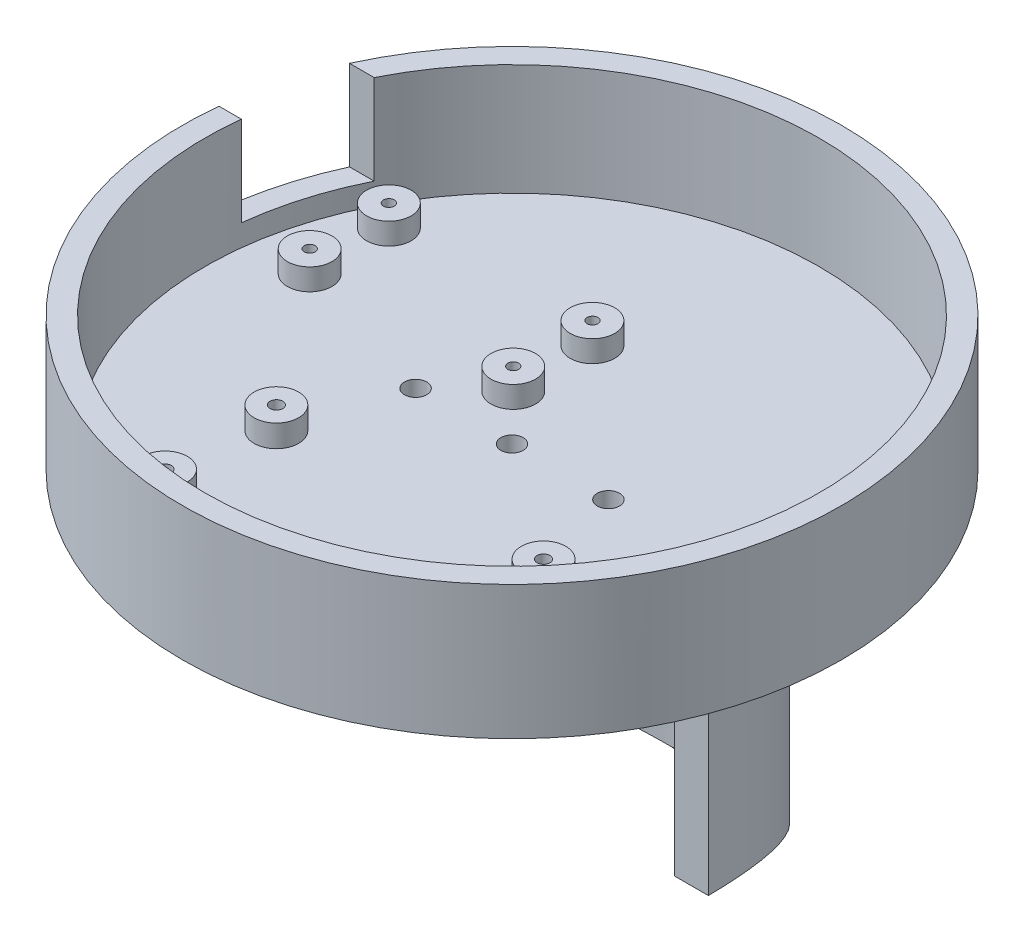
ISO-10303-21;
HEADER;
FILE_DESCRIPTION(('STEP AP214'),'2;1');
FILE_NAME('part.step','',(''),(''),'','','');
FILE_SCHEMA(('AUTOMOTIVE_DESIGN { 1 0 10303 214 1 1 1 1 }'));
ENDSEC;
DATA;
#1=APPLICATION_CONTEXT('core data for automotive mechanical design processes');
#2=APPLICATION_PROTOCOL_DEFINITION('international standard','automotive_design',2000,#1);
#3=PRODUCT_CONTEXT('',#1,'mechanical');
#4=PRODUCT('Part','Part','',(#3));
#5=PRODUCT_RELATED_PRODUCT_CATEGORY('part','',(#4));
#6=PRODUCT_DEFINITION_FORMATION('','',#4);
#7=PRODUCT_DEFINITION_CONTEXT('part definition',#1,'design');
#8=PRODUCT_DEFINITION('design','',#6,#7);
#9=PRODUCT_DEFINITION_SHAPE('','',#8);
#10=(LENGTH_UNIT() NAMED_UNIT(*) SI_UNIT(.MILLI.,.METRE.));
#11=(NAMED_UNIT(*) PLANE_ANGLE_UNIT() SI_UNIT($,.RADIAN.));
#12=(NAMED_UNIT(*) SI_UNIT($,.STERADIAN.) SOLID_ANGLE_UNIT());
#13=UNCERTAINTY_MEASURE_WITH_UNIT(LENGTH_MEASURE(1.E-05),#10,'distance_accuracy_value','');
#14=(GEOMETRIC_REPRESENTATION_CONTEXT(3) GLOBAL_UNCERTAINTY_ASSIGNED_CONTEXT((#13)) GLOBAL_UNIT_ASSIGNED_CONTEXT((#10,
#11,#12)) REPRESENTATION_CONTEXT('',''));
#15=CARTESIAN_POINT('',(0.,0.,0.));
#16=DIRECTION('',(0.,0.,1.));
#17=DIRECTION('',(1.,0.,0.));
#18=AXIS2_PLACEMENT_3D('',#15,#16,#17);
#19=CARTESIAN_POINT('',(0.,9.85142185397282,-65.816698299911));
#20=DIRECTION('',(0.,-1.,0.));
#21=DIRECTION('',(0.,0.,-1.));
#22=AXIS2_PLACEMENT_3D('',#19,#20,#21);
#23=PLANE('',#22);
#24=CARTESIAN_POINT('',(-92.3493057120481,9.85142185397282,-45.4266982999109));
#25=DIRECTION('',(0.,-1.,0.));
#26=DIRECTION('',(0.,0.,-1.));
#27=AXIS2_PLACEMENT_3D('',#24,#25,#26);
#28=CIRCLE('',#27,1.2192);
#29=CARTESIAN_POINT('',(-92.3493057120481,9.85142185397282,-46.6458982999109));
#30=VERTEX_POINT('',#29);
#31=EDGE_CURVE('E256',#30,#30,#28,.F.);
#32=ORIENTED_EDGE('',*,*,#31,.F.);
#33=EDGE_LOOP('',(#32));
#34=FACE_BOUND('',#33,.T.);
#35=CARTESIAN_POINT('',(-92.3493057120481,9.85142185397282,-45.4266982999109));
#36=DIRECTION('',(0.,1.,0.));
#37=DIRECTION('',(0.,0.,1.));
#38=AXIS2_PLACEMENT_3D('',#35,#36,#37);
#39=CIRCLE('',#38,5.);
#40=CARTESIAN_POINT('',(-92.3493057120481,9.85142185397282,-40.4266982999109));
#41=VERTEX_POINT('',#40);
#42=EDGE_CURVE('E424',#41,#41,#39,.T.);
#43=ORIENTED_EDGE('',*,*,#42,.T.);
#44=EDGE_LOOP('',(#43));
#45=FACE_BOUND('',#44,.T.);
#46=ADVANCED_FACE('F72',(#34,#45),#23,.F.);
#47=CARTESIAN_POINT('',(-92.3493057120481,9.85142185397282,-63.2066982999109));
#48=DIRECTION('',(0.,-1.,0.));
#49=DIRECTION('',(0.,0.,-1.));
#50=AXIS2_PLACEMENT_3D('',#47,#48,#49);
#51=CIRCLE('',#50,1.2192);
#52=CARTESIAN_POINT('',(-92.3493057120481,9.85142185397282,-64.425898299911));
#53=VERTEX_POINT('',#52);
#54=EDGE_CURVE('E76',#53,#53,#51,.F.);
#55=ORIENTED_EDGE('',*,*,#54,.F.);
#56=EDGE_LOOP('',(#55));
#57=FACE_BOUND('',#56,.T.);
#58=CARTESIAN_POINT('',(-92.3493057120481,9.85142185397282,-63.2066982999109));
#59=DIRECTION('',(0.,1.,0.));
#60=DIRECTION('',(0.,0.,1.));
#61=AXIS2_PLACEMENT_3D('',#58,#59,#60);
#62=CIRCLE('',#61,5.00000000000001);
#63=CARTESIAN_POINT('',(-92.3493057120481,9.85142185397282,-58.2066982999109));
#64=VERTEX_POINT('',#63);
#65=EDGE_CURVE('E432',#64,#64,#62,.T.);
#66=ORIENTED_EDGE('',*,*,#65,.T.);
#67=EDGE_LOOP('',(#66));
#68=FACE_BOUND('',#67,.T.);
#69=ADVANCED_FACE('F372',(#57,#68),#23,.F.);
#70=CARTESIAN_POINT('',(-46.6293057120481,9.85142185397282,-63.2066982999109));
#71=DIRECTION('',(0.,-1.,0.));
#72=DIRECTION('',(0.,0.,-1.));
#73=AXIS2_PLACEMENT_3D('',#70,#71,#72);
#74=CIRCLE('',#73,1.2192);
#75=CARTESIAN_POINT('',(-46.6293057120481,9.85142185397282,-64.4258982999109));
#76=VERTEX_POINT('',#75);
#77=EDGE_CURVE('E248',#76,#76,#74,.F.);
#78=ORIENTED_EDGE('',*,*,#77,.F.);
#79=EDGE_LOOP('',(#78));
#80=FACE_BOUND('',#79,.T.);
#81=CARTESIAN_POINT('',(-46.6293057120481,9.85142185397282,-63.2066982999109));
#82=DIRECTION('',(0.,1.,0.));
#83=DIRECTION('',(0.,0.,1.));
#84=AXIS2_PLACEMENT_3D('',#81,#82,#83);
#85=CIRCLE('',#84,5.);
#86=CARTESIAN_POINT('',(-46.6293057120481,9.85142185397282,-58.206698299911));
#87=VERTEX_POINT('',#86);
#88=EDGE_CURVE('E421',#87,#87,#85,.T.);
#89=ORIENTED_EDGE('',*,*,#88,.T.);
#90=EDGE_LOOP('',(#89));
#91=FACE_BOUND('',#90,.T.);
#92=ADVANCED_FACE('F379',(#80,#91),#23,.F.);
#93=CARTESIAN_POINT('',(-46.6293057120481,9.85142185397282,-45.426698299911));
#94=DIRECTION('',(0.,-1.,0.));
#95=DIRECTION('',(0.,0.,-1.));
#96=AXIS2_PLACEMENT_3D('',#93,#94,#95);
#97=CIRCLE('',#96,1.2192);
#98=CARTESIAN_POINT('',(-46.6293057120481,9.85142185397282,-46.645898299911));
#99=VERTEX_POINT('',#98);
#100=EDGE_CURVE('E252',#99,#99,#97,.F.);
#101=ORIENTED_EDGE('',*,*,#100,.F.);
#102=EDGE_LOOP('',(#101));
#103=FACE_BOUND('',#102,.T.);
#104=CARTESIAN_POINT('',(-46.6293057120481,9.85142185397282,-45.426698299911));
#105=DIRECTION('',(0.,1.,0.));
#106=DIRECTION('',(0.,0.,1.));
#107=AXIS2_PLACEMENT_3D('',#104,#105,#106);
#108=CIRCLE('',#107,5.00000000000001);
#109=CARTESIAN_POINT('',(-46.6293057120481,9.85142185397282,-40.426698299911));
#110=VERTEX_POINT('',#109);
#111=EDGE_CURVE('E412',#110,#110,#108,.T.);
#112=ORIENTED_EDGE('',*,*,#111,.T.);
#113=EDGE_LOOP('',(#112));
#114=FACE_BOUND('',#113,.T.);
#115=ADVANCED_FACE('F389',(#103,#114),#23,.F.);
#116=CARTESIAN_POINT('',(-36.5084583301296,20.,-35.0226489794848));
#117=DIRECTION('',(0.,-1.,0.));
#118=DIRECTION('',(0.,0.,-1.));
#119=AXIS2_PLACEMENT_3D('',#116,#117,#118);
#120=CYLINDRICAL_SURFACE('',#119,74.);
#121=CARTESIAN_POINT('',(-36.5084583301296,0.,-35.0226489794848));
#122=DIRECTION('',(0.,1.,0.));
#123=DIRECTION('',(0.,0.,1.));
#124=AXIS2_PLACEMENT_3D('',#121,#122,#123);
#125=CIRCLE('',#124,74.);
#126=CARTESIAN_POINT('',(-36.5084583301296,0.,38.9773510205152));
#127=VERTEX_POINT('',#126);
#128=EDGE_CURVE('E982',#127,#127,#125,.T.);
#129=ORIENTED_EDGE('',*,*,#128,.T.);
#130=EDGE_LOOP('',(#129));
#131=FACE_BOUND('',#130,.T.);
#132=DIRECTION('',(0.,-1.,0.));
#133=VECTOR('',#132,1.);
#134=CARTESIAN_POINT('',(-103.796841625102,20.,-65.816698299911));
#135=LINE('',#134,#133);
#136=CARTESIAN_POINT('',(-103.796841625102,30.,-65.816698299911));
#137=VERTEX_POINT('',#136);
#138=CARTESIAN_POINT('',(-103.796841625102,9.85142185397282,-65.816698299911));
#139=VERTEX_POINT('',#138);
#140=EDGE_CURVE('E284',#137,#139,#135,.T.);
#141=ORIENTED_EDGE('',*,*,#140,.F.);
#142=CARTESIAN_POINT('',(-36.5084583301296,30.,-35.0226489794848));
#143=DIRECTION('',(0.,1.,0.));
#144=DIRECTION('',(0.,0.,1.));
#145=AXIS2_PLACEMENT_3D('',#142,#143,#144);
#146=CIRCLE('',#145,74.);
#147=CARTESIAN_POINT('',(-110.096859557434,30.,-42.816698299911));
#148=VERTEX_POINT('',#147);
#149=EDGE_CURVE('E307',#148,#137,#146,.T.);
#150=ORIENTED_EDGE('',*,*,#149,.F.);
#151=DIRECTION('',(0.,-1.,0.));
#152=VECTOR('',#151,1.);
#153=CARTESIAN_POINT('',(-110.096859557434,20.,-42.816698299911));
#154=LINE('',#153,#152);
#155=CARTESIAN_POINT('',(-110.096859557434,9.85142185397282,-42.816698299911));
#156=VERTEX_POINT('',#155);
#157=EDGE_CURVE('E272',#148,#156,#154,.T.);
#158=ORIENTED_EDGE('',*,*,#157,.T.);
#159=CARTESIAN_POINT('',(-36.5084583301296,9.85142185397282,-35.0226489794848));
#160=DIRECTION('',(0.,-1.,0.));
#161=DIRECTION('',(0.,0.,-1.));
#162=AXIS2_PLACEMENT_3D('',#159,#160,#161);
#163=CIRCLE('',#162,74.);
#164=EDGE_CURVE('E263',#156,#139,#163,.T.);
#165=ORIENTED_EDGE('',*,*,#164,.T.);
#166=EDGE_LOOP('',(#141,#150,#158,#165));
#167=FACE_BOUND('',#166,.T.);
#168=ADVANCED_FACE('F74',(#131,#167),#120,.T.);
#169=CARTESIAN_POINT('',(-36.5084583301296,30.,-35.0226489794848));
#170=DIRECTION('',(0.,1.,0.));
#171=DIRECTION('',(0.,0.,1.));
#172=AXIS2_PLACEMENT_3D('',#169,#170,#171);
#173=PLANE('',#172);
#174=ORIENTED_EDGE('',*,*,#149,.T.);
#175=DIRECTION('',(1.,0.,0.));
#176=VECTOR('',#175,1.);
#177=CARTESIAN_POINT('',(-36.5084583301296,30.,-65.816698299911));
#178=LINE('',#177,#176);
#179=CARTESIAN_POINT('',(-98.255737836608,30.,-65.816698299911));
#180=VERTEX_POINT('',#179);
#181=EDGE_CURVE('E280',#137,#180,#178,.T.);
#182=ORIENTED_EDGE('',*,*,#181,.T.);
#183=CARTESIAN_POINT('',(-36.5084583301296,30.,-35.0226489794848));
#184=DIRECTION('',(0.,1.,0.));
#185=DIRECTION('',(0.,0.,1.));
#186=AXIS2_PLACEMENT_3D('',#183,#184,#185);
#187=CIRCLE('',#186,69.);
#188=CARTESIAN_POINT('',(-105.066848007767,30.,-42.816698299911));
#189=VERTEX_POINT('',#188);
#190=EDGE_CURVE('E303',#189,#180,#187,.T.);
#191=ORIENTED_EDGE('',*,*,#190,.F.);
#192=DIRECTION('',(1.,0.,0.));
#193=VECTOR('',#192,1.);
#194=CARTESIAN_POINT('',(-36.5084583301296,30.,-42.816698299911));
#195=LINE('',#194,#193);
#196=EDGE_CURVE('E89',#148,#189,#195,.T.);
#197=ORIENTED_EDGE('',*,*,#196,.F.);
#198=EDGE_LOOP('',(#174,#182,#191,#197));
#199=FACE_BOUND('',#198,.T.);
#200=ADVANCED_FACE('F405',(#199),#173,.T.);
#201=CARTESIAN_POINT('',(-36.5084583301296,30.,-35.0226489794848));
#202=DIRECTION('',(0.,-1.,0.));
#203=DIRECTION('',(0.,0.,-1.));
#204=AXIS2_PLACEMENT_3D('',#201,#202,#203);
#205=CYLINDRICAL_SURFACE('',#204,69.);
#206=CARTESIAN_POINT('',(-36.5084583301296,5.,-35.0226489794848));
#207=DIRECTION('',(0.,1.,0.));
#208=DIRECTION('',(0.,0.,1.));
#209=AXIS2_PLACEMENT_3D('',#206,#207,#208);
#210=CIRCLE('',#209,69.);
#211=CARTESIAN_POINT('',(-36.5084583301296,5.,33.9773510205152));
#212=VERTEX_POINT('',#211);
#213=EDGE_CURVE('E12',#212,#212,#210,.F.);
#214=ORIENTED_EDGE('',*,*,#213,.T.);
#215=EDGE_LOOP('',(#214));
#216=FACE_BOUND('',#215,.T.);
#217=ORIENTED_EDGE('',*,*,#190,.T.);
#218=DIRECTION('',(0.,-1.,0.));
#219=VECTOR('',#218,1.);
#220=CARTESIAN_POINT('',(-98.255737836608,30.,-65.816698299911));
#221=LINE('',#220,#219);
#222=CARTESIAN_POINT('',(-98.255737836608,9.85142185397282,-65.816698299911));
#223=VERTEX_POINT('',#222);
#224=EDGE_CURVE('E276',#180,#223,#221,.T.);
#225=ORIENTED_EDGE('',*,*,#224,.T.);
#226=CARTESIAN_POINT('',(-36.5084583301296,9.85142185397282,-35.0226489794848));
#227=DIRECTION('',(0.,-1.,0.));
#228=DIRECTION('',(0.,0.,-1.));
#229=AXIS2_PLACEMENT_3D('',#226,#227,#228);
#230=CIRCLE('',#229,69.);
#231=CARTESIAN_POINT('',(-105.066848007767,9.85142185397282,-42.816698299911));
#232=VERTEX_POINT('',#231);
#233=EDGE_CURVE('E260',#232,#223,#230,.T.);
#234=ORIENTED_EDGE('',*,*,#233,.F.);
#235=DIRECTION('',(0.,-1.,0.));
#236=VECTOR('',#235,1.);
#237=CARTESIAN_POINT('',(-105.066848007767,30.,-42.816698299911));
#238=LINE('',#237,#236);
#239=EDGE_CURVE('E267',#189,#232,#238,.T.);
#240=ORIENTED_EDGE('',*,*,#239,.F.);
#241=EDGE_LOOP('',(#217,#225,#234,#240));
#242=FACE_BOUND('',#241,.T.);
#243=ADVANCED_FACE('F453',(#216,#242),#205,.F.);
#244=CARTESIAN_POINT('',(-36.5084583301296,5.,-35.0226489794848));
#245=DIRECTION('',(0.,1.,0.));
#246=DIRECTION('',(0.,0.,1.));
#247=AXIS2_PLACEMENT_3D('',#244,#245,#246);
#248=PLANE('',#247);
#249=CARTESIAN_POINT('',(-46.6293057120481,5.,-63.2066982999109));
#250=DIRECTION('',(0.,1.,0.));
#251=DIRECTION('',(0.,0.,1.));
#252=AXIS2_PLACEMENT_3D('',#249,#250,#251);
#253=CIRCLE('',#252,5.);
#254=CARTESIAN_POINT('',(-46.6293057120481,5.,-58.206698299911));
#255=VERTEX_POINT('',#254);
#256=EDGE_CURVE('E428',#255,#255,#253,.F.);
#257=ORIENTED_EDGE('',*,*,#256,.T.);
#258=EDGE_LOOP('',(#257));
#259=FACE_BOUND('',#258,.T.);
#260=CARTESIAN_POINT('',(-92.3493057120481,5.,-63.2066982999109));
#261=DIRECTION('',(0.,1.,0.));
#262=DIRECTION('',(0.,0.,1.));
#263=AXIS2_PLACEMENT_3D('',#260,#261,#262);
#264=CIRCLE('',#263,5.00000000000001);
#265=CARTESIAN_POINT('',(-92.3493057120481,5.,-58.2066982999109));
#266=VERTEX_POINT('',#265);
#267=EDGE_CURVE('E181',#266,#266,#264,.F.);
#268=ORIENTED_EDGE('',*,*,#267,.T.);
#269=EDGE_LOOP('',(#268));
#270=FACE_BOUND('',#269,.T.);
#271=CARTESIAN_POINT('',(-46.6293057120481,5.,-45.426698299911));
#272=DIRECTION('',(0.,1.,0.));
#273=DIRECTION('',(0.,0.,1.));
#274=AXIS2_PLACEMENT_3D('',#271,#272,#273);
#275=CIRCLE('',#274,5.00000000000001);
#276=CARTESIAN_POINT('',(-46.6293057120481,5.,-40.426698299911));
#277=VERTEX_POINT('',#276);
#278=EDGE_CURVE('E415',#277,#277,#275,.F.);
#279=ORIENTED_EDGE('',*,*,#278,.T.);
#280=EDGE_LOOP('',(#279));
#281=FACE_BOUND('',#280,.T.);
#282=CARTESIAN_POINT('',(-92.3493057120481,5.,-45.4266982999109));
#283=DIRECTION('',(0.,1.,0.));
#284=DIRECTION('',(0.,0.,1.));
#285=AXIS2_PLACEMENT_3D('',#282,#283,#284);
#286=CIRCLE('',#285,5.);
#287=CARTESIAN_POINT('',(-92.3493057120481,5.,-40.4266982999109));
#288=VERTEX_POINT('',#287);
#289=EDGE_CURVE('E416',#288,#288,#286,.F.);
#290=ORIENTED_EDGE('',*,*,#289,.T.);
#291=EDGE_LOOP('',(#290));
#292=FACE_BOUND('',#291,.T.);
#293=CARTESIAN_POINT('',(-65.5722806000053,5.,13.8297399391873));
#294=DIRECTION('',(0.,1.,0.));
#295=DIRECTION('',(0.,0.,1.));
#296=AXIS2_PLACEMENT_3D('',#293,#294,#295);
#297=CIRCLE('',#296,5.);
#298=CARTESIAN_POINT('',(-65.5722806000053,5.,18.8297399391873));
#299=VERTEX_POINT('',#298);
#300=EDGE_CURVE('E204',#299,#299,#297,.T.);
#301=ORIENTED_EDGE('',*,*,#300,.F.);
#302=EDGE_LOOP('',(#301));
#303=FACE_BOUND('',#302,.T.);
#304=CARTESIAN_POINT('',(-5.57228060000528,5.,13.8297399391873));
#305=DIRECTION('',(0.,1.,0.));
#306=DIRECTION('',(0.,0.,1.));
#307=AXIS2_PLACEMENT_3D('',#304,#305,#306);
#308=CIRCLE('',#307,5.);
#309=CARTESIAN_POINT('',(-5.57228060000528,5.,18.8297399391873));
#310=VERTEX_POINT('',#309);
#311=EDGE_CURVE('E209',#310,#310,#308,.T.);
#312=ORIENTED_EDGE('',*,*,#311,.F.);
#313=EDGE_LOOP('',(#312));
#314=FACE_BOUND('',#313,.T.);
#315=CARTESIAN_POINT('',(-5.57228060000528,5.,-11.1702600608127));
#316=DIRECTION('',(0.,1.,0.));
#317=DIRECTION('',(0.,0.,1.));
#318=AXIS2_PLACEMENT_3D('',#315,#316,#317);
#319=CIRCLE('',#318,5.);
#320=CARTESIAN_POINT('',(-5.57228060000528,5.,-6.17026006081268));
#321=VERTEX_POINT('',#320);
#322=EDGE_CURVE('E217',#321,#321,#319,.T.);
#323=ORIENTED_EDGE('',*,*,#322,.F.);
#324=EDGE_LOOP('',(#323));
#325=FACE_BOUND('',#324,.T.);
#326=CARTESIAN_POINT('',(-65.5722806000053,5.,-11.1702600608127));
#327=DIRECTION('',(0.,1.,0.));
#328=DIRECTION('',(0.,0.,1.));
#329=AXIS2_PLACEMENT_3D('',#326,#327,#328);
#330=CIRCLE('',#329,5.);
#331=CARTESIAN_POINT('',(-65.5722806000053,5.,-6.17026006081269));
#332=VERTEX_POINT('',#331);
#333=EDGE_CURVE('E225',#332,#332,#330,.T.);
#334=ORIENTED_EDGE('',*,*,#333,.F.);
#335=EDGE_LOOP('',(#334));
#336=FACE_BOUND('',#335,.T.);
#337=CARTESIAN_POINT('',(-58.1584583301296,5.,-35.0226489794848));
#338=DIRECTION('',(0.,1.,0.));
#339=DIRECTION('',(0.,0.,1.));
#340=AXIS2_PLACEMENT_3D('',#337,#338,#339);
#341=CIRCLE('',#340,2.5);
#342=CARTESIAN_POINT('',(-58.1584583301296,5.,-32.5226489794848));
#343=VERTEX_POINT('',#342);
#344=EDGE_CURVE('E316',#343,#343,#341,.F.);
#345=ORIENTED_EDGE('',*,*,#344,.T.);
#346=EDGE_LOOP('',(#345));
#347=FACE_BOUND('',#346,.T.);
#348=CARTESIAN_POINT('',(-14.8584583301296,5.,-35.0226489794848));
#349=DIRECTION('',(0.,1.,0.));
#350=DIRECTION('',(0.,0.,1.));
#351=AXIS2_PLACEMENT_3D('',#348,#349,#350);
#352=CIRCLE('',#351,2.5);
#353=CARTESIAN_POINT('',(-14.8584583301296,5.,-32.5226489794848));
#354=VERTEX_POINT('',#353);
#355=EDGE_CURVE('E312',#354,#354,#352,.F.);
#356=ORIENTED_EDGE('',*,*,#355,.T.);
#357=EDGE_LOOP('',(#356));
#358=FACE_BOUND('',#357,.T.);
#359=CARTESIAN_POINT('',(-36.5084583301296,5.,-35.0226489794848));
#360=DIRECTION('',(0.,1.,0.));
#361=DIRECTION('',(0.,0.,1.));
#362=AXIS2_PLACEMENT_3D('',#359,#360,#361);
#363=CIRCLE('',#362,2.5);
#364=CARTESIAN_POINT('',(-36.5084583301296,5.,-32.5226489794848));
#365=VERTEX_POINT('',#364);
#366=EDGE_CURVE('E311',#365,#365,#363,.F.);
#367=ORIENTED_EDGE('',*,*,#366,.T.);
#368=EDGE_LOOP('',(#367));
#369=FACE_BOUND('',#368,.T.);
#370=ORIENTED_EDGE('',*,*,#213,.F.);
#371=EDGE_LOOP('',(#370));
#372=FACE_BOUND('',#371,.T.);
#373=ADVANCED_FACE('F336',(#259,#270,#281,#292,#303,#314,#325,#336,#347,#358,#369,#372),#248,.T.);
#374=CARTESIAN_POINT('',(-58.1584583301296,0.,-35.0226489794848));
#375=DIRECTION('',(0.,-1.,0.));
#376=DIRECTION('',(0.,0.,-1.));
#377=AXIS2_PLACEMENT_3D('',#374,#375,#376);
#378=CYLINDRICAL_SURFACE('',#377,2.5);
#379=CARTESIAN_POINT('',(-58.1584583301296,0.,-35.0226489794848));
#380=DIRECTION('',(0.,-1.,0.));
#381=DIRECTION('',(0.,0.,-1.));
#382=AXIS2_PLACEMENT_3D('',#379,#380,#381);
#383=CIRCLE('',#382,2.5);
#384=CARTESIAN_POINT('',(-58.1584583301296,0.,-37.5226489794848));
#385=VERTEX_POINT('',#384);
#386=EDGE_CURVE('E1004',#385,#385,#383,.T.);
#387=ORIENTED_EDGE('',*,*,#386,.T.);
#388=EDGE_LOOP('',(#387));
#389=FACE_BOUND('',#388,.T.);
#390=ORIENTED_EDGE('',*,*,#344,.F.);
#391=EDGE_LOOP('',(#390));
#392=FACE_BOUND('',#391,.T.);
#393=ADVANCED_FACE('F452',(#389,#392),#378,.F.);
#394=CARTESIAN_POINT('',(-14.8584583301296,0.,-35.0226489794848));
#395=DIRECTION('',(0.,-1.,0.));
#396=DIRECTION('',(0.,0.,-1.));
#397=AXIS2_PLACEMENT_3D('',#394,#395,#396);
#398=CYLINDRICAL_SURFACE('',#397,2.5);
#399=CARTESIAN_POINT('',(-14.8584583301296,0.,-35.0226489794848));
#400=DIRECTION('',(0.,-1.,0.));
#401=DIRECTION('',(0.,0.,-1.));
#402=AXIS2_PLACEMENT_3D('',#399,#400,#401);
#403=CIRCLE('',#402,2.5);
#404=CARTESIAN_POINT('',(-14.8584583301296,0.,-37.5226489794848));
#405=VERTEX_POINT('',#404);
#406=EDGE_CURVE('E1001',#405,#405,#403,.T.);
#407=ORIENTED_EDGE('',*,*,#406,.T.);
#408=EDGE_LOOP('',(#407));
#409=FACE_BOUND('',#408,.T.);
#410=ORIENTED_EDGE('',*,*,#355,.F.);
#411=EDGE_LOOP('',(#410));
#412=FACE_BOUND('',#411,.T.);
#413=ADVANCED_FACE('F863',(#409,#412),#398,.F.);
#414=CARTESIAN_POINT('',(-36.5084583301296,0.,-35.0226489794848));
#415=DIRECTION('',(0.,-1.,0.));
#416=DIRECTION('',(0.,0.,-1.));
#417=AXIS2_PLACEMENT_3D('',#414,#415,#416);
#418=CYLINDRICAL_SURFACE('',#417,2.5);
#419=CARTESIAN_POINT('',(-36.5084583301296,0.,-35.0226489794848));
#420=DIRECTION('',(0.,-1.,0.));
#421=DIRECTION('',(0.,0.,-1.));
#422=AXIS2_PLACEMENT_3D('',#419,#420,#421);
#423=CIRCLE('',#422,2.5);
#424=CARTESIAN_POINT('',(-36.5084583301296,0.,-37.5226489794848));
#425=VERTEX_POINT('',#424);
#426=EDGE_CURVE('E351',#425,#425,#423,.T.);
#427=ORIENTED_EDGE('',*,*,#426,.T.);
#428=EDGE_LOOP('',(#427));
#429=FACE_BOUND('',#428,.T.);
#430=ORIENTED_EDGE('',*,*,#366,.F.);
#431=EDGE_LOOP('',(#430));
#432=FACE_BOUND('',#431,.T.);
#433=ADVANCED_FACE('F338',(#429,#432),#418,.F.);
#434=CARTESIAN_POINT('',(7.59178476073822,-70.,-35.0226489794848));
#435=DIRECTION('',(0.,0.,-1.));
#436=DIRECTION('',(-1.,0.,0.));
#437=AXIS2_PLACEMENT_3D('',#434,#435,#436);
#438=PLANE('',#437);
#439=DIRECTION('',(0.,1.,0.));
#440=VECTOR('',#439,1.);
#441=CARTESIAN_POINT('',(0.,-70.,-35.0226489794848));
#442=LINE('',#441,#440);
#443=CARTESIAN_POINT('',(0.,-60.7797729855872,-35.0226489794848));
#444=VERTEX_POINT('',#443);
#445=CARTESIAN_POINT('',(0.,0.,-35.0226489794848));
#446=VERTEX_POINT('',#445);
#447=EDGE_CURVE('E969',#444,#446,#442,.T.);
#448=ORIENTED_EDGE('',*,*,#447,.F.);
#449=DIRECTION('',(1.,0.,0.));
#450=VECTOR('',#449,1.);
#451=CARTESIAN_POINT('',(-110.50845833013,-60.7797729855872,-35.0226489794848));
#452=LINE('',#451,#450);
#453=CARTESIAN_POINT('',(7.59178476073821,-60.7797729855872,-35.0226489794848));
#454=VERTEX_POINT('',#453);
#455=EDGE_CURVE('E352',#444,#454,#452,.T.);
#456=ORIENTED_EDGE('',*,*,#455,.T.);
#457=DIRECTION('',(0.,1.,0.));
#458=VECTOR('',#457,1.);
#459=CARTESIAN_POINT('',(7.59178476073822,-70.,-35.0226489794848));
#460=LINE('',#459,#458);
#461=CARTESIAN_POINT('',(7.59178476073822,0.,-35.0226489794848));
#462=VERTEX_POINT('',#461);
#463=EDGE_CURVE('E974',#454,#462,#460,.T.);
#464=ORIENTED_EDGE('',*,*,#463,.T.);
#465=DIRECTION('',(-1.,0.,0.));
#466=VECTOR('',#465,1.);
#467=CARTESIAN_POINT('',(7.59178476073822,0.,-35.0226489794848));
#468=LINE('',#467,#466);
#469=EDGE_CURVE('E1011',#462,#446,#468,.T.);
#470=ORIENTED_EDGE('',*,*,#469,.T.);
#471=EDGE_LOOP('',(#448,#456,#464,#470));
#472=FACE_BOUND('',#471,.T.);
#473=ADVANCED_FACE('F360',(#472),#438,.F.);
#474=CARTESIAN_POINT('',(-73.0169166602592,-70.,-35.0226489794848));
#475=DIRECTION('',(0.,0.,-1.));
#476=DIRECTION('',(-1.,0.,0.));
#477=AXIS2_PLACEMENT_3D('',#474,#475,#476);
#478=PLANE('',#477);
#479=DIRECTION('',(0.,1.,0.));
#480=VECTOR('',#479,1.);
#481=CARTESIAN_POINT('',(-80.6087014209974,-70.,-35.0226489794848));
#482=LINE('',#481,#480);
#483=CARTESIAN_POINT('',(-80.6087014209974,-60.7797729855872,-35.0226489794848));
#484=VERTEX_POINT('',#483);
#485=CARTESIAN_POINT('',(-80.6087014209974,0.,-35.0226489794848));
#486=VERTEX_POINT('',#485);
#487=EDGE_CURVE('E970',#484,#486,#482,.T.);
#488=ORIENTED_EDGE('',*,*,#487,.F.);
#489=DIRECTION('',(1.,0.,0.));
#490=VECTOR('',#489,1.);
#491=CARTESIAN_POINT('',(-110.50845833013,-60.7797729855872,-35.0226489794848));
#492=LINE('',#491,#490);
#493=CARTESIAN_POINT('',(-73.0169166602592,-60.7797729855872,-35.0226489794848));
#494=VERTEX_POINT('',#493);
#495=EDGE_CURVE('E82',#484,#494,#492,.T.);
#496=ORIENTED_EDGE('',*,*,#495,.T.);
#497=DIRECTION('',(0.,1.,0.));
#498=VECTOR('',#497,1.);
#499=CARTESIAN_POINT('',(-73.0169166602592,-70.,-35.0226489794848));
#500=LINE('',#499,#498);
#501=CARTESIAN_POINT('',(-73.0169166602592,0.,-35.0226489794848));
#502=VERTEX_POINT('',#501);
#503=EDGE_CURVE('E962',#494,#502,#500,.T.);
#504=ORIENTED_EDGE('',*,*,#503,.T.);
#505=DIRECTION('',(-1.,0.,0.));
#506=VECTOR('',#505,1.);
#507=CARTESIAN_POINT('',(-73.0169166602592,0.,-35.0226489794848));
#508=LINE('',#507,#506);
#509=EDGE_CURVE('E976',#502,#486,#508,.T.);
#510=ORIENTED_EDGE('',*,*,#509,.T.);
#511=EDGE_LOOP('',(#488,#496,#504,#510));
#512=FACE_BOUND('',#511,.T.);
#513=ADVANCED_FACE('F362',(#512),#478,.F.);
#514=CARTESIAN_POINT('',(-36.5084583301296,0.,-35.0226489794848));
#515=DIRECTION('',(0.,1.,0.));
#516=DIRECTION('',(0.,0.,1.));
#517=AXIS2_PLACEMENT_3D('',#514,#515,#516);
#518=PLANE('',#517);
#519=ORIENTED_EDGE('',*,*,#426,.F.);
#520=EDGE_LOOP('',(#519));
#521=FACE_BOUND('',#520,.T.);
#522=ORIENTED_EDGE('',*,*,#406,.F.);
#523=EDGE_LOOP('',(#522));
#524=FACE_BOUND('',#523,.T.);
#525=ORIENTED_EDGE('',*,*,#386,.F.);
#526=EDGE_LOOP('',(#525));
#527=FACE_BOUND('',#526,.T.);
#528=ORIENTED_EDGE('',*,*,#128,.F.);
#529=EDGE_LOOP('',(#528));
#530=FACE_BOUND('',#529,.T.);
#531=CARTESIAN_POINT('',(-36.5084583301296,0.,-35.0226489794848));
#532=DIRECTION('',(0.,-1.,0.));
#533=DIRECTION('',(0.,0.,1.));
#534=AXIS2_PLACEMENT_3D('',#531,#532,#533);
#535=CIRCLE('',#534,44.1002430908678);
#536=EDGE_CURVE('E1007',#486,#462,#535,.T.);
#537=ORIENTED_EDGE('',*,*,#536,.F.);
#538=ORIENTED_EDGE('',*,*,#509,.F.);
#539=CARTESIAN_POINT('',(-36.5084583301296,0.,-35.0226489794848));
#540=DIRECTION('',(0.,1.,0.));
#541=DIRECTION('',(0.,0.,1.));
#542=AXIS2_PLACEMENT_3D('',#539,#540,#541);
#543=CIRCLE('',#542,36.5084583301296);
#544=EDGE_CURVE('E965',#446,#502,#543,.T.);
#545=ORIENTED_EDGE('',*,*,#544,.F.);
#546=ORIENTED_EDGE('',*,*,#469,.F.);
#547=EDGE_LOOP('',(#537,#538,#545,#546));
#548=FACE_BOUND('',#547,.T.);
#549=ADVANCED_FACE('F358',(#521,#524,#527,#530,#548),#518,.F.);
#550=CARTESIAN_POINT('',(-36.5084583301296,-70.,-35.0226489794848));
#551=DIRECTION('',(0.,1.,0.));
#552=DIRECTION('',(0.,0.,1.));
#553=AXIS2_PLACEMENT_3D('',#550,#551,#552);
#554=CYLINDRICAL_SURFACE('',#553,44.1002430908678);
#555=ORIENTED_EDGE('',*,*,#463,.F.);
#556=CARTESIAN_POINT('',(7.59178476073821,-60.7797729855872,-35.0226489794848));
#557=CARTESIAN_POINT('',(7.59178557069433,-60.7760718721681,-35.3758441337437));
#558=CARTESIAN_POINT('',(7.58754126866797,-60.7752431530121,-35.729049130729));
#559=CARTESIAN_POINT('',(7.57057097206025,-60.7793246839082,-36.435220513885));
#560=CARTESIAN_POINT('',(7.55784501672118,-60.7842349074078,-36.7881869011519));
#561=CARTESIAN_POINT('',(7.50697474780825,-60.8075573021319,-37.8459850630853));
#562=CARTESIAN_POINT('',(7.45613801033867,-60.8345574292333,-38.5500773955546));
#563=CARTESIAN_POINT('',(7.32091333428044,-60.9112300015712,-39.9536450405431));
#564=CARTESIAN_POINT('',(7.23653001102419,-60.960899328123,-40.6531209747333));
#565=CARTESIAN_POINT('',(7.03522288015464,-61.0821903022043,-42.041838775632));
#566=CARTESIAN_POINT('',(6.91846490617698,-61.1537002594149,-42.7311144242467));
#567=CARTESIAN_POINT('',(6.65290622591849,-61.3181896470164,-44.1009098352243));
#568=CARTESIAN_POINT('',(6.50410343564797,-61.4111704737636,-44.7814290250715));
#569=CARTESIAN_POINT('',(6.17530450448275,-61.6178799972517,-46.1316841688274));
#570=CARTESIAN_POINT('',(5.99530835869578,-61.7316086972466,-46.8014201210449));
#571=CARTESIAN_POINT('',(5.60536606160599,-61.9787984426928,-48.1273873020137));
#572=CARTESIAN_POINT('',(5.39546066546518,-62.1122326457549,-48.783635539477));
#573=CARTESIAN_POINT('',(4.9465991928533,-62.3979920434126,-50.0819121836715));
#574=CARTESIAN_POINT('',(4.70764322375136,-62.5503171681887,-50.7239406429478));
#575=CARTESIAN_POINT('',(4.20183990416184,-62.8728120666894,-51.9923043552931));
#576=CARTESIAN_POINT('',(3.93499319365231,-63.0429814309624,-52.6186399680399));
#577=CARTESIAN_POINT('',(3.37434919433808,-63.4002153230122,-53.8549144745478));
#578=CARTESIAN_POINT('',(3.08052754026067,-63.5872951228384,-54.4648378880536));
#579=CARTESIAN_POINT('',(2.46735391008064,-63.9770503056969,-55.6665955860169));
#580=CARTESIAN_POINT('',(2.14800187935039,-64.1797257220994,-56.2584298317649));
#581=CARTESIAN_POINT('',(1.48499325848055,-64.5994490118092,-57.4230547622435));
#582=CARTESIAN_POINT('',(1.14133574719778,-64.816497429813,-57.995844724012));
#583=CARTESIAN_POINT('',(0.201743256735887,-65.4079855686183,-59.4846807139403));
#584=CARTESIAN_POINT('',(-0.413973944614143,-65.793666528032,-60.3839010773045));
#585=CARTESIAN_POINT('',(-1.70296574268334,-66.594871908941,-62.1258517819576));
#586=CARTESIAN_POINT('',(-2.37624383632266,-67.010398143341,-62.968578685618));
#587=CARTESIAN_POINT('',(-3.7764332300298,-67.8657545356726,-64.5962744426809));
#588=CARTESIAN_POINT('',(-4.50338451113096,-68.3056027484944,-65.3811993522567));
#589=CARTESIAN_POINT('',(-6.0066723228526,-69.2032134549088,-66.8912489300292));
#590=CARTESIAN_POINT('',(-6.78301040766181,-69.660976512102,-67.6163717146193));
#591=CARTESIAN_POINT('',(-8.2072094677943,-70.4865524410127,-68.8539345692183));
#592=CARTESIAN_POINT('',(-8.8460923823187,-70.8521720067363,-69.3782336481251));
#593=CARTESIAN_POINT('',(-10.1510869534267,-71.5869907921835,-70.3893257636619));
#594=CARTESIAN_POINT('',(-10.8172020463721,-71.9561904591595,-70.8761140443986));
#595=CARTESIAN_POINT('',(-12.1758774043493,-72.6944370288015,-71.8117435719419));
#596=CARTESIAN_POINT('',(-12.8684429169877,-73.0634838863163,-72.2605772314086));
#597=CARTESIAN_POINT('',(-14.2795407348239,-73.7971791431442,-73.1197507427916));
#598=CARTESIAN_POINT('',(-14.9980780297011,-74.1618266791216,-73.5300831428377));
#599=CARTESIAN_POINT('',(-16.4606699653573,-74.8816609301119,-74.3113868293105));
#600=CARTESIAN_POINT('',(-17.2047199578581,-75.236849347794,-74.6823652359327));
#601=CARTESIAN_POINT('',(-18.7182847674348,-75.9319079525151,-75.3839765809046));
#602=CARTESIAN_POINT('',(-19.4877917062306,-76.2717828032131,-75.7146218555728));
#603=CARTESIAN_POINT('',(-21.060539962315,-76.9326824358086,-76.3374857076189));
#604=CARTESIAN_POINT('',(-21.8640424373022,-77.2534836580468,-76.629285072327));
#605=CARTESIAN_POINT('',(-23.4973824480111,-77.8638808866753,-77.1686220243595));
#606=CARTESIAN_POINT('',(-24.3272185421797,-78.1534785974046,-77.416162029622));
#607=CARTESIAN_POINT('',(-26.0108061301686,-78.6907994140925,-77.8640678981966));
#608=CARTESIAN_POINT('',(-26.8644957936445,-78.9386208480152,-78.0645449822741));
#609=CARTESIAN_POINT('',(-28.1624294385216,-79.2711320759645,-78.3281944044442));
#610=CARTESIAN_POINT('',(-28.5979893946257,-79.3754352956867,-78.4099020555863));
#611=CARTESIAN_POINT('',(-29.4744831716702,-79.5695718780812,-78.5605899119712));
#612=CARTESIAN_POINT('',(-29.9154163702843,-79.6594068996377,-78.6295715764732));
#613=CARTESIAN_POINT('',(-30.85182962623,-79.8324526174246,-78.7614409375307));
#614=CARTESIAN_POINT('',(-31.3478781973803,-79.9137886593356,-78.8227761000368));
#615=CARTESIAN_POINT('',(-32.3447580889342,-80.0552046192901,-78.9287562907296));
#616=CARTESIAN_POINT('',(-32.8455891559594,-80.1152856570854,-78.9734021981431));
#617=CARTESIAN_POINT('',(-33.8506443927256,-80.2128393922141,-79.0456118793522));
#618=CARTESIAN_POINT('',(-34.3548682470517,-80.2503141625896,-79.0731772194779));
#619=CARTESIAN_POINT('',(-35.3647389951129,-80.3017429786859,-79.1109516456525));
#620=CARTESIAN_POINT('',(-35.8703842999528,-80.3157171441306,-79.1211755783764));
#621=CARTESIAN_POINT('',(-36.8818726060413,-80.3198625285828,-79.1242114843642));
#622=CARTESIAN_POINT('',(-37.3877156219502,-80.3100313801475,-79.1170217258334));
#623=CARTESIAN_POINT('',(-38.3978260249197,-80.2668028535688,-79.0852979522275));
#624=CARTESIAN_POINT('',(-38.9020934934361,-80.2334067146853,-79.0607648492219));
#625=CARTESIAN_POINT('',(-39.7803308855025,-80.1551864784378,-79.0029628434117));
#626=CARTESIAN_POINT('',(-40.1550110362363,-80.1153861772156,-78.973470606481));
#627=CARTESIAN_POINT('',(-40.9020244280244,-80.023607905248,-78.9050912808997));
#628=CARTESIAN_POINT('',(-41.2743575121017,-79.971629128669,-78.8662035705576));
#629=CARTESIAN_POINT('',(-42.3869554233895,-79.7983458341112,-78.7357139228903));
#630=CARTESIAN_POINT('',(-43.1229875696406,-79.6596788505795,-78.6302742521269));
#631=CARTESIAN_POINT('',(-44.5815968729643,-79.3417544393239,-78.3839732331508));
#632=CARTESIAN_POINT('',(-45.3041435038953,-79.162414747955,-78.2430400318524));
#633=CARTESIAN_POINT('',(-46.7325080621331,-78.7698091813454,-77.927605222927));
#634=CARTESIAN_POINT('',(-47.4383236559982,-78.5565386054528,-77.7530989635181));
#635=CARTESIAN_POINT('',(-48.9084774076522,-78.0775327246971,-77.3512875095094));
#636=CARTESIAN_POINT('',(-49.6707608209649,-77.8086096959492,-77.1202931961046));
#637=CARTESIAN_POINT('',(-51.1733032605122,-77.2444539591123,-76.6207372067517));
#638=CARTESIAN_POINT('',(-51.9135510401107,-76.9492081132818,-76.3521567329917));
#639=CARTESIAN_POINT('',(-53.3718262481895,-76.3391578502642,-75.7789025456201));
#640=CARTESIAN_POINT('',(-54.0898485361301,-76.0243489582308,-75.4742205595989));
#641=CARTESIAN_POINT('',(-55.5049076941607,-75.3803433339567,-74.8293319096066));
#642=CARTESIAN_POINT('',(-56.2019044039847,-75.0511216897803,-74.4890622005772));
#643=CARTESIAN_POINT('',(-57.5734365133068,-74.3837496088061,-73.7743705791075));
#644=CARTESIAN_POINT('',(-58.2479780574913,-74.045601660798,-73.399958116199));
#645=CARTESIAN_POINT('',(-59.5747015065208,-73.364410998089,-72.6175016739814));
#646=CARTESIAN_POINT('',(-60.2268836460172,-73.0213683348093,-72.2094580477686));
#647=CARTESIAN_POINT('',(-61.3710557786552,-72.4077057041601,-71.451308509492));
#648=CARTESIAN_POINT('',(-61.8673982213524,-72.1373356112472,-71.1075508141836));
#649=CARTESIAN_POINT('',(-62.845819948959,-71.5973158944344,-70.3997522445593));
#650=CARTESIAN_POINT('',(-63.3278984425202,-71.3276663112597,-70.0357102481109));
#651=CARTESIAN_POINT('',(-64.7522511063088,-70.5219541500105,-68.9133721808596));
#652=CARTESIAN_POINT('',(-65.6727581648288,-69.9890655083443,-68.1247873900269));
#653=CARTESIAN_POINT('',(-67.4502154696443,-68.9430581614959,-66.4696211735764));
#654=CARTESIAN_POINT('',(-68.3072436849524,-68.4299155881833,-65.6031384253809));
#655=CARTESIAN_POINT('',(-69.9538123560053,-67.4320419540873,-63.793048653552));
#656=CARTESIAN_POINT('',(-70.743361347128,-66.94730730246,-62.8494514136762));
#657=CARTESIAN_POINT('',(-72.1732111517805,-66.061791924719,-60.9859862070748));
#658=CARTESIAN_POINT('',(-72.8205408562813,-65.6574638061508,-60.0731895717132));
#659=CARTESIAN_POINT('',(-74.0501264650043,-64.8851845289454,-58.1898362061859));
#660=CARTESIAN_POINT('',(-74.6323835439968,-64.5172327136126,-57.219280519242));
#661=CARTESIAN_POINT('',(-75.4524222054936,-63.9972595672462,-55.7234406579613));
#662=CARTESIAN_POINT('',(-75.7168952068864,-63.8292494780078,-55.2181200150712));
#663=CARTESIAN_POINT('',(-76.2273692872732,-63.504574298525,-54.1946712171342));
#664=CARTESIAN_POINT('',(-76.4733717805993,-63.3479083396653,-53.6765440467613));
#665=CARTESIAN_POINT('',(-76.9461119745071,-63.0466643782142,-52.6282763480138));
#666=CARTESIAN_POINT('',(-77.1728541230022,-62.9020835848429,-52.0981386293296));
#667=CARTESIAN_POINT('',(-77.6064657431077,-62.6256097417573,-51.0263852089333));
#668=CARTESIAN_POINT('',(-77.8133294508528,-62.4937203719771,-50.484766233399));
#669=CARTESIAN_POINT('',(-78.3590359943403,-62.1460909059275,-48.9663183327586));
#670=CARTESIAN_POINT('',(-78.6756614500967,-61.9447446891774,-47.9780554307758));
#671=CARTESIAN_POINT('',(-79.2399451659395,-61.5876074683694,-45.9741077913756));
#672=CARTESIAN_POINT('',(-79.4876203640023,-61.4318052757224,-44.9584298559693));
#673=CARTESIAN_POINT('',(-79.7697049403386,-61.2562728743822,-43.5910642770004));
#674=CARTESIAN_POINT('',(-79.8361587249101,-61.2151070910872,-43.2484529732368));
#675=CARTESIAN_POINT('',(-79.9609994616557,-61.138187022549,-42.5612175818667));
#676=CARTESIAN_POINT('',(-80.0193879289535,-61.1024317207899,-42.2165938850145));
#677=CARTESIAN_POINT('',(-80.1823283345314,-61.0033896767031,-41.1800587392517));
#678=CARTESIAN_POINT('',(-80.2746747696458,-60.9483146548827,-40.4853888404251));
#679=CARTESIAN_POINT('',(-80.4261905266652,-60.8605633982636,-39.0914837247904));
#680=CARTESIAN_POINT('',(-80.4853808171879,-60.8278730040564,-38.3922516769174));
#681=CARTESIAN_POINT('',(-80.5548033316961,-60.792924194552,-37.2473245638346));
#682=CARTESIAN_POINT('',(-80.5750233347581,-60.7839090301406,-36.802410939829));
#683=CARTESIAN_POINT('',(-80.6019677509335,-60.7750054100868,-35.9125386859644));
#684=CARTESIAN_POINT('',(-80.6087059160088,-60.7751076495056,-35.4675805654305));
#685=CARTESIAN_POINT('',(-80.6087014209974,-60.7797729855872,-35.0226489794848));
#686=B_SPLINE_CURVE_WITH_KNOTS('',3,(#556,#557,#558,#559,#560,#561,#562,#563,#564,#565,#566,
#567,#568,#569,#570,#571,#572,#573,#574,#575,#576,#577,#578,#579,#580,#581,#582,#583,#584,#585,
#586,#587,#588,#589,#590,#591,#592,#593,#594,#595,#596,#597,#598,#599,#600,#601,#602,#603,#604,
#605,#606,#607,#608,#609,#610,#611,#612,#613,#614,#615,#616,#617,#618,#619,#620,#621,#622,#623,
#624,#625,#626,#627,#628,#629,#630,#631,#632,#633,#634,#635,#636,#637,#638,#639,#640,#641,#642,
#643,#644,#645,#646,#647,#648,#649,#650,#651,#652,#653,#654,#655,#656,#657,#658,#659,#660,#661,
#662,#663,#664,#665,#666,#667,#668,#669,#670,#671,#672,#673,#674,#675,#676,#677,#678,#679,#680,
#681,#682,#683,#684,#685),.UNSPECIFIED.,.F.,.F.,(4,2,2,2,2,2,2,2,2,2,2,2,2,2,2,2,2,2,2,2,2,2,2,
2,2,2,2,2,2,2,2,2,2,2,2,2,2,2,2,2,2,2,2,2,2,2,2,2,2,2,2,2,2,2,2,2,2,2,2,2,2,2,2,2,4),(0.,
1.05956604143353,2.11912718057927,4.23716637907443,6.35491427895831,8.46200863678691,
10.5692400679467,12.6764718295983,14.780859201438,16.885238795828,18.9895701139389,
21.0958212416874,23.2020768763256,25.3084123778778,28.7729662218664,32.2377306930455,
35.7051026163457,39.1725837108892,41.8826475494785,44.5930544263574,47.3040018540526,
50.0154729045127,52.7264525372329,55.4366008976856,58.1739639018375,60.9111773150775,
63.6418554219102,65.0072900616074,66.3725680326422,67.8910549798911,69.4094619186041,
70.92772959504,72.4446967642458,73.9618148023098,75.4788530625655,76.6123554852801,
77.7459329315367,80.0125801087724,82.2838532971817,84.5554414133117,87.0757698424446,
89.5973632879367,92.119535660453,94.646254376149,97.1722758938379,99.6982708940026,
101.682404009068,103.666646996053,107.634677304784,111.597750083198,115.560320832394,
119.126435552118,122.692485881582,124.475780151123,126.25893772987,128.04168238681,
129.824942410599,132.992623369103,136.159525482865,137.213673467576,138.267623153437,
140.375231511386,142.481505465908,143.817620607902,145.152372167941),.UNSPECIFIED.);
#687=EDGE_CURVE('E342',#454,#484,#686,.T.);
#688=ORIENTED_EDGE('',*,*,#687,.T.);
#689=ORIENTED_EDGE('',*,*,#487,.T.);
#690=ORIENTED_EDGE('',*,*,#536,.T.);
#691=EDGE_LOOP('',(#555,#688,#689,#690));
#692=FACE_BOUND('',#691,.T.);
#693=ADVANCED_FACE('F354',(#692),#554,.T.);
#694=CARTESIAN_POINT('',(-36.5084583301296,-70.,-35.0226489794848));
#695=DIRECTION('',(0.,1.,0.));
#696=DIRECTION('',(0.,0.,1.));
#697=AXIS2_PLACEMENT_3D('',#694,#695,#696);
#698=CYLINDRICAL_SURFACE('',#697,36.5084583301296);
#699=ORIENTED_EDGE('',*,*,#503,.F.);
#700=CARTESIAN_POINT('',(-73.0169166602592,-60.7797729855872,-35.0226489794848));
#701=CARTESIAN_POINT('',(-73.0169491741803,-60.7732598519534,-35.6414777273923));
#702=CARTESIAN_POINT('',(-73.0011839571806,-60.7756163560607,-36.2603903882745));
#703=CARTESIAN_POINT('',(-72.9382764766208,-60.7978860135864,-37.4960702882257));
#704=CARTESIAN_POINT('',(-72.8911460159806,-60.8177925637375,-38.1128382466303));
#705=CARTESIAN_POINT('',(-72.765734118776,-60.8749714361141,-39.3423061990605));
#706=CARTESIAN_POINT('',(-72.6874566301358,-60.912241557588,-39.955006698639));
#707=CARTESIAN_POINT('',(-72.5006043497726,-61.0035534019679,-41.171629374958));
#708=CARTESIAN_POINT('',(-72.3921692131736,-61.0575179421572,-41.7755788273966));
#709=CARTESIAN_POINT('',(-72.1454092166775,-61.1817588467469,-42.9756723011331));
#710=CARTESIAN_POINT('',(-72.0070826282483,-61.2520361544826,-43.5718158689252));
#711=CARTESIAN_POINT('',(-71.7012429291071,-61.4082427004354,-44.7544784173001));
#712=CARTESIAN_POINT('',(-71.5337298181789,-61.4941719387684,-45.3409973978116));
#713=CARTESIAN_POINT('',(-71.1705349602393,-61.6807944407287,-46.5020901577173));
#714=CARTESIAN_POINT('',(-70.97488579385,-61.7814706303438,-47.0766768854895));
#715=CARTESIAN_POINT('',(-70.5561671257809,-61.99677395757,-48.2130907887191));
#716=CARTESIAN_POINT('',(-70.3330976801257,-62.1114010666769,-48.7749179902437));
#717=CARTESIAN_POINT('',(-69.8604930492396,-62.3536253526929,-49.8844425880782));
#718=CARTESIAN_POINT('',(-69.6109583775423,-62.4812222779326,-50.4321402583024));
#719=CARTESIAN_POINT('',(-69.0862058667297,-62.7484310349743,-51.5126121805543));
#720=CARTESIAN_POINT('',(-68.8109684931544,-62.8880519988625,-52.0453746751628));
#721=CARTESIAN_POINT('',(-68.2359657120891,-63.1780994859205,-53.0944666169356));
#722=CARTESIAN_POINT('',(-67.9362002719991,-63.3285260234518,-53.6107960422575));
#723=CARTESIAN_POINT('',(-67.3131460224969,-63.6389885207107,-54.626056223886));
#724=CARTESIAN_POINT('',(-66.989856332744,-63.7990248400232,-55.1249863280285));
#725=CARTESIAN_POINT('',(-66.1160666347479,-64.2279271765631,-56.4041978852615));
#726=CARTESIAN_POINT('',(-65.5474968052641,-64.5035097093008,-57.1699970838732));
#727=CARTESIAN_POINT('',(-64.355620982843,-65.0709613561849,-58.651170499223));
#728=CARTESIAN_POINT('',(-63.7323125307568,-65.3628312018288,-59.3665424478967));
#729=CARTESIAN_POINT('',(-62.4337047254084,-65.9573757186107,-60.7451436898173));
#730=CARTESIAN_POINT('',(-61.7583515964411,-66.2600613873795,-61.4083175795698));
#731=CARTESIAN_POINT('',(-60.3593204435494,-66.8697057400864,-62.6794261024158));
#732=CARTESIAN_POINT('',(-59.6356401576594,-67.1766646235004,-63.2873581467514));
#733=CARTESIAN_POINT('',(-58.0540350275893,-67.8244234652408,-64.5145613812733));
#734=CARTESIAN_POINT('',(-57.1903700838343,-68.164917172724,-65.1266189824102));
#735=CARTESIAN_POINT('',(-55.4092803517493,-68.8325038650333,-66.2756452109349));
#736=CARTESIAN_POINT('',(-54.4918463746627,-69.1595945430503,-66.8126009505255));
#737=CARTESIAN_POINT('',(-52.6077380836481,-69.788461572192,-67.8070098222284));
#738=CARTESIAN_POINT('',(-51.6411134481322,-70.0902626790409,-68.2645411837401));
#739=CARTESIAN_POINT('',(-49.6620666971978,-70.6561500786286,-69.0961147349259));
#740=CARTESIAN_POINT('',(-48.649660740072,-70.9202495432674,-69.470186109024));
#741=CARTESIAN_POINT('',(-46.8294311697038,-71.3408617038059,-70.0516292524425));
#742=CARTESIAN_POINT('',(-46.0299362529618,-71.5080415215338,-70.2774995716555));
#743=CARTESIAN_POINT('',(-44.410985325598,-71.8068400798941,-70.675302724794));
#744=CARTESIAN_POINT('',(-43.5915323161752,-71.9384641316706,-70.8472436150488));
#745=CARTESIAN_POINT('',(-42.3516709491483,-72.1052416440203,-71.0629087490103));
#746=CARTESIAN_POINT('',(-41.936847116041,-72.1557039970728,-71.1277307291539));
#747=CARTESIAN_POINT('',(-41.1040830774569,-72.2459461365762,-71.2431454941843));
#748=CARTESIAN_POINT('',(-40.686143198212,-72.2857270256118,-71.2937397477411));
#749=CARTESIAN_POINT('',(-39.8478192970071,-72.3541627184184,-71.3805065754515));
#750=CARTESIAN_POINT('',(-39.4274350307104,-72.3828163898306,-71.4166776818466));
#751=CARTESIAN_POINT('',(-38.5850783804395,-72.4286644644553,-71.4744446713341));
#752=CARTESIAN_POINT('',(-38.1631061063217,-72.4458596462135,-71.4960415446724));
#753=CARTESIAN_POINT('',(-37.1758244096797,-72.4724170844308,-71.5293814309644));
#754=CARTESIAN_POINT('',(-36.6101795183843,-72.477180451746,-71.5353429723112));
#755=CARTESIAN_POINT('',(-35.4794312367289,-72.4657297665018,-71.5209830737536));
#756=CARTESIAN_POINT('',(-34.9143278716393,-72.4495147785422,-71.5006604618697));
#757=CARTESIAN_POINT('',(-33.7866641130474,-72.3964538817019,-71.4338885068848));
#758=CARTESIAN_POINT('',(-33.2241036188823,-72.3596087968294,-71.3874402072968));
#759=CARTESIAN_POINT('',(-32.1029094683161,-72.2660097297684,-71.2687075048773));
#760=CARTESIAN_POINT('',(-31.544279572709,-72.2092387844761,-71.1964010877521));
#761=CARTESIAN_POINT('',(-30.4331275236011,-72.076915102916,-71.0264511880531));
#762=CARTESIAN_POINT('',(-29.8806055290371,-72.0013618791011,-70.9288070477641));
#763=CARTESIAN_POINT('',(-28.7832355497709,-71.8328919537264,-70.7088043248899));
#764=CARTESIAN_POINT('',(-28.2383874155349,-71.7399755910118,-70.5864462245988));
#765=CARTESIAN_POINT('',(-26.9095256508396,-71.4920896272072,-70.2559848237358));
#766=CARTESIAN_POINT('',(-26.1305131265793,-71.3282123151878,-70.034301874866));
#767=CARTESIAN_POINT('',(-24.594629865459,-70.9722490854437,-69.5419024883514));
#768=CARTESIAN_POINT('',(-23.837764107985,-70.7801568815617,-69.2711751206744));
#769=CARTESIAN_POINT('',(-22.7210585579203,-70.4750522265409,-68.8299772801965));
#770=CARTESIAN_POINT('',(-22.3518552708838,-70.3705019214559,-68.6770284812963));
#771=CARTESIAN_POINT('',(-21.6199675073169,-70.1564406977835,-68.3597065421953));
#772=CARTESIAN_POINT('',(-21.2572814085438,-70.0469310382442,-68.1953362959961));
#773=CARTESIAN_POINT('',(-20.1790914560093,-69.7118856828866,-67.6853432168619));
#774=CARTESIAN_POINT('',(-19.4735073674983,-69.4798478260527,-67.3228584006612));
#775=CARTESIAN_POINT('',(-17.9535118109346,-68.9563592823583,-66.478646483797));
#776=CARTESIAN_POINT('',(-17.1452377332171,-68.6622461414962,-65.9875236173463));
#777=CARTESIAN_POINT('',(-15.5715436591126,-68.0644675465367,-64.9459440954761));
#778=CARTESIAN_POINT('',(-14.8061277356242,-67.7608011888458,-64.3954818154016));
#779=CARTESIAN_POINT('',(-13.3201277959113,-67.1509906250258,-63.2371295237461));
#780=CARTESIAN_POINT('',(-12.5995762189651,-66.844844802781,-62.6291987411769));
#781=CARTESIAN_POINT('',(-11.2066077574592,-66.2369637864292,-61.3584194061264));
#782=CARTESIAN_POINT('',(-10.5341932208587,-65.9352288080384,-60.6955681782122));
#783=CARTESIAN_POINT('',(-9.15130631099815,-65.3014435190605,-59.2220366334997));
#784=CARTESIAN_POINT('',(-8.44837318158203,-64.970950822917,-58.4035758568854));
#785=CARTESIAN_POINT('',(-7.11394484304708,-64.3321669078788,-56.7021172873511));
#786=CARTESIAN_POINT('',(-6.48245784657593,-64.023878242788,-55.8191120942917));
#787=CARTESIAN_POINT('',(-5.29652503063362,-63.4373526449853,-53.992824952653));
#788=CARTESIAN_POINT('',(-4.74209030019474,-63.1591200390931,-53.0495343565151));
#789=CARTESIAN_POINT('',(-3.97313244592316,-62.7699759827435,-51.594355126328));
#790=CARTESIAN_POINT('',(-3.72724372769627,-62.6449525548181,-51.102544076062));
#791=CARTESIAN_POINT('',(-3.25707202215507,-62.4051218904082,-50.1062860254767));
#792=CARTESIAN_POINT('',(-3.03278687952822,-62.2903136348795,-49.6018402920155));
#793=CARTESIAN_POINT('',(-2.55400270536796,-62.0447570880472,-48.4553599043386));
#794=CARTESIAN_POINT('',(-2.30569254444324,-61.9170598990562,-47.8100726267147));
#795=CARTESIAN_POINT('',(-1.84521417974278,-61.6802257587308,-46.5033689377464));
#796=CARTESIAN_POINT('',(-1.63304715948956,-61.5710894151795,-45.8419519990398));
#797=CARTESIAN_POINT('',(-1.24610931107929,-61.3726257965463,-44.5051861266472));
#798=CARTESIAN_POINT('',(-1.07134585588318,-61.2833024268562,-43.8298344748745));
#799=CARTESIAN_POINT('',(-0.760834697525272,-61.1257884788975,-42.4698003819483));
#800=CARTESIAN_POINT('',(-0.624978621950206,-61.0575391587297,-41.7851495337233));
#801=CARTESIAN_POINT('',(-0.392559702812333,-60.9426877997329,-40.4075612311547));
#802=CARTESIAN_POINT('',(-0.295989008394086,-60.8960814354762,-39.7146254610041));
#803=CARTESIAN_POINT('',(-0.142829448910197,-60.8251258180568,-38.3237808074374));
#804=CARTESIAN_POINT('',(-0.0862047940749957,-60.8007566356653,-37.6258769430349));
#805=CARTESIAN_POINT('',(-0.0331232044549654,-60.7816943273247,-36.6096092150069));
#806=CARTESIAN_POINT('',(-0.0206957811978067,-60.7780622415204,-36.2921574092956));
#807=CARTESIAN_POINT('',(-0.00413847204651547,-60.7754413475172,-35.6573528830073));
#808=CARTESIAN_POINT('',(1.37950369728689E-07,-60.7764476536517,-35.3400004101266));
#809=CARTESIAN_POINT('',(0.,-60.7797729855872,-35.0226489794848));
#810=B_SPLINE_CURVE_WITH_KNOTS('',3,(#700,#701,#702,#703,#704,#705,#706,#707,#708,#709,#710,
#711,#712,#713,#714,#715,#716,#717,#718,#719,#720,#721,#722,#723,#724,#725,#726,#727,#728,#729,
#730,#731,#732,#733,#734,#735,#736,#737,#738,#739,#740,#741,#742,#743,#744,#745,#746,#747,#748,
#749,#750,#751,#752,#753,#754,#755,#756,#757,#758,#759,#760,#761,#762,#763,#764,#765,#766,#767,
#768,#769,#770,#771,#772,#773,#774,#775,#776,#777,#778,#779,#780,#781,#782,#783,#784,#785,#786,
#787,#788,#789,#790,#791,#792,#793,#794,#795,#796,#797,#798,#799,#800,#801,#802,#803,#804,#805,
#806,#807,#808,#809),.UNSPECIFIED.,.F.,.F.,(4,2,2,2,2,2,2,2,2,2,2,2,2,2,2,2,2,2,2,2,2,2,2,2,2,2,
2,2,2,2,2,2,2,2,2,2,2,2,2,2,2,2,2,2,2,2,2,2,2,2,2,2,2,2,4),(0.,1.85631066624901,
3.71192318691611,5.56730058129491,7.41422512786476,9.26125650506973,11.1082878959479,
12.953197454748,14.7981032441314,16.6429732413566,18.4892569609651,20.3355431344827,
22.1818984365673,25.1570896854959,28.1324146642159,31.1108562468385,34.0894373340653,
37.4214409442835,40.7540156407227,44.0832890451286,47.4113964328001,49.9513607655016,
52.4909454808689,53.7592679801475,55.0274595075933,56.2957800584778,57.5640144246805,
59.2600585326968,60.9561782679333,62.6522302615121,64.3497296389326,66.0472730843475,
67.74478340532,70.2213788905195,72.6985269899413,73.9375621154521,75.1762844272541,
77.6539000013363,80.6224244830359,83.5912305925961,86.5621589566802,89.5332321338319,
92.9140265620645,96.2952092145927,99.6768779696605,101.368003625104,103.058960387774,
105.166917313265,107.274943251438,109.383384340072,111.48589416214,113.587983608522,
115.688187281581,116.641215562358,117.59324023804),.UNSPECIFIED.);
#811=EDGE_CURVE('E97',#494,#444,#810,.T.);
#812=ORIENTED_EDGE('',*,*,#811,.T.);
#813=ORIENTED_EDGE('',*,*,#447,.T.);
#814=ORIENTED_EDGE('',*,*,#544,.T.);
#815=EDGE_LOOP('',(#699,#812,#813,#814));
#816=FACE_BOUND('',#815,.T.);
#817=ADVANCED_FACE('F335',(#816),#698,.F.);
#818=CARTESIAN_POINT('',(-110.50845833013,-100.124878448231,-35.0226489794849));
#819=DIRECTION('',(1.,0.,0.));
#820=DIRECTION('',(0.,0.0264058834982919,-0.99965130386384));
#821=AXIS2_PLACEMENT_3D('',#818,#819,#820);
#822=ELLIPSE('',#821,50.6514371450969,39.3396624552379);
#823=DIRECTION('',(1.,0.,0.));
#824=VECTOR('',#823,1.);
#825=SURFACE_OF_LINEAR_EXTRUSION('',#822,#824);
#826=ORIENTED_EDGE('',*,*,#455,.F.);
#827=ORIENTED_EDGE('',*,*,#811,.F.);
#828=ORIENTED_EDGE('',*,*,#495,.F.);
#829=ORIENTED_EDGE('',*,*,#687,.F.);
#830=EDGE_LOOP('',(#826,#827,#828,#829));
#831=FACE_BOUND('',#830,.T.);
#832=ADVANCED_FACE('F329',(#831),#825,.F.);
#833=CARTESIAN_POINT('',(-46.6293057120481,5.,-63.2066982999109));
#834=DIRECTION('',(0.,1.,0.));
#835=DIRECTION('',(0.,0.,1.));
#836=AXIS2_PLACEMENT_3D('',#833,#834,#835);
#837=CONICAL_SURFACE('',#836,1.2192,1.02974425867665);
#838=CARTESIAN_POINT('',(-46.6293057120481,4.2674307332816,-63.2066982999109));
#839=VERTEX_POINT('',#838);
#840=VERTEX_LOOP('',#839);
#841=FACE_BOUND('',#840,.T.);
#842=CARTESIAN_POINT('',(-46.6293057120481,5.,-63.2066982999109));
#843=DIRECTION('',(0.,1.,0.));
#844=DIRECTION('',(0.,0.,1.));
#845=AXIS2_PLACEMENT_3D('',#842,#843,#844);
#846=CIRCLE('',#845,1.2192);
#847=CARTESIAN_POINT('',(-46.6293057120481,5.,-61.987498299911));
#848=VERTEX_POINT('',#847);
#849=EDGE_CURVE('E291',#848,#848,#846,.T.);
#850=ORIENTED_EDGE('',*,*,#849,.T.);
#851=EDGE_LOOP('',(#850));
#852=FACE_BOUND('',#851,.T.);
#853=ADVANCED_FACE('F334',(#841,#852),#837,.F.);
#854=CARTESIAN_POINT('',(-46.6293057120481,10.,-63.2066982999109));
#855=DIRECTION('',(0.,1.,0.));
#856=DIRECTION('',(0.,0.,1.));
#857=AXIS2_PLACEMENT_3D('',#854,#855,#856);
#858=CYLINDRICAL_SURFACE('',#857,1.2192);
#859=ORIENTED_EDGE('',*,*,#77,.T.);
#860=EDGE_LOOP('',(#859));
#861=FACE_BOUND('',#860,.T.);
#862=ORIENTED_EDGE('',*,*,#849,.F.);
#863=EDGE_LOOP('',(#862));
#864=FACE_BOUND('',#863,.T.);
#865=ADVANCED_FACE('F690',(#861,#864),#858,.F.);
#866=CARTESIAN_POINT('',(-46.6293057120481,5.,-45.426698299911));
#867=DIRECTION('',(0.,1.,0.));
#868=DIRECTION('',(0.,0.,1.));
#869=AXIS2_PLACEMENT_3D('',#866,#867,#868);
#870=CONICAL_SURFACE('',#869,1.2192,1.02974425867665);
#871=CARTESIAN_POINT('',(-46.6293057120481,4.2674307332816,-45.426698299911));
#872=VERTEX_POINT('',#871);
#873=VERTEX_LOOP('',#872);
#874=FACE_BOUND('',#873,.T.);
#875=CARTESIAN_POINT('',(-46.6293057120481,5.,-45.426698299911));
#876=DIRECTION('',(0.,1.,0.));
#877=DIRECTION('',(0.,0.,1.));
#878=AXIS2_PLACEMENT_3D('',#875,#876,#877);
#879=CIRCLE('',#878,1.2192);
#880=CARTESIAN_POINT('',(-46.6293057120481,5.,-44.207498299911));
#881=VERTEX_POINT('',#880);
#882=EDGE_CURVE('E295',#881,#881,#879,.T.);
#883=ORIENTED_EDGE('',*,*,#882,.T.);
#884=EDGE_LOOP('',(#883));
#885=FACE_BOUND('',#884,.T.);
#886=ADVANCED_FACE('F694',(#874,#885),#870,.F.);
#887=CARTESIAN_POINT('',(-46.6293057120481,10.,-45.426698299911));
#888=DIRECTION('',(0.,1.,0.));
#889=DIRECTION('',(0.,0.,1.));
#890=AXIS2_PLACEMENT_3D('',#887,#888,#889);
#891=CYLINDRICAL_SURFACE('',#890,1.2192);
#892=ORIENTED_EDGE('',*,*,#100,.T.);
#893=EDGE_LOOP('',(#892));
#894=FACE_BOUND('',#893,.T.);
#895=ORIENTED_EDGE('',*,*,#882,.F.);
#896=EDGE_LOOP('',(#895));
#897=FACE_BOUND('',#896,.T.);
#898=ADVANCED_FACE('F701',(#894,#897),#891,.F.);
#899=CARTESIAN_POINT('',(-92.3493057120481,5.,-45.4266982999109));
#900=DIRECTION('',(0.,1.,0.));
#901=DIRECTION('',(0.,0.,1.));
#902=AXIS2_PLACEMENT_3D('',#899,#900,#901);
#903=CONICAL_SURFACE('',#902,1.2192,1.02974425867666);
#904=CARTESIAN_POINT('',(-92.3493057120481,4.2674307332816,-45.4266982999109));
#905=VERTEX_POINT('',#904);
#906=VERTEX_LOOP('',#905);
#907=FACE_BOUND('',#906,.T.);
#908=CARTESIAN_POINT('',(-92.3493057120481,5.,-45.4266982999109));
#909=DIRECTION('',(0.,1.,0.));
#910=DIRECTION('',(0.,0.,1.));
#911=AXIS2_PLACEMENT_3D('',#908,#909,#910);
#912=CIRCLE('',#911,1.2192);
#913=CARTESIAN_POINT('',(-92.3493057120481,5.,-44.2074982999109));
#914=VERTEX_POINT('',#913);
#915=EDGE_CURVE('E299',#914,#914,#912,.T.);
#916=ORIENTED_EDGE('',*,*,#915,.T.);
#917=EDGE_LOOP('',(#916));
#918=FACE_BOUND('',#917,.T.);
#919=ADVANCED_FACE('F493',(#907,#918),#903,.F.);
#920=CARTESIAN_POINT('',(-92.3493057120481,10.,-45.4266982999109));
#921=DIRECTION('',(0.,1.,0.));
#922=DIRECTION('',(0.,0.,1.));
#923=AXIS2_PLACEMENT_3D('',#920,#921,#922);
#924=CYLINDRICAL_SURFACE('',#923,1.2192);
#925=ORIENTED_EDGE('',*,*,#31,.T.);
#926=EDGE_LOOP('',(#925));
#927=FACE_BOUND('',#926,.T.);
#928=ORIENTED_EDGE('',*,*,#915,.F.);
#929=EDGE_LOOP('',(#928));
#930=FACE_BOUND('',#929,.T.);
#931=ADVANCED_FACE('F488',(#927,#930),#924,.F.);
#932=CARTESIAN_POINT('',(0.,9.85142185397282,-65.816698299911));
#933=DIRECTION('',(0.,0.,1.));
#934=DIRECTION('',(1.,0.,0.));
#935=AXIS2_PLACEMENT_3D('',#932,#933,#934);
#936=PLANE('',#935);
#937=ORIENTED_EDGE('',*,*,#140,.T.);
#938=DIRECTION('',(-1.,0.,0.));
#939=VECTOR('',#938,1.);
#940=CARTESIAN_POINT('',(0.,9.85142185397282,-65.816698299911));
#941=LINE('',#940,#939);
#942=EDGE_CURVE('E233',#223,#139,#941,.T.);
#943=ORIENTED_EDGE('',*,*,#942,.F.);
#944=ORIENTED_EDGE('',*,*,#224,.F.);
#945=ORIENTED_EDGE('',*,*,#181,.F.);
#946=EDGE_LOOP('',(#937,#943,#944,#945));
#947=FACE_BOUND('',#946,.T.);
#948=ADVANCED_FACE('F397',(#947),#936,.T.);
#949=CARTESIAN_POINT('',(0.,9.85142185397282,-42.816698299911));
#950=DIRECTION('',(0.,0.,1.));
#951=DIRECTION('',(1.,0.,0.));
#952=AXIS2_PLACEMENT_3D('',#949,#950,#951);
#953=PLANE('',#952);
#954=ORIENTED_EDGE('',*,*,#196,.T.);
#955=ORIENTED_EDGE('',*,*,#239,.T.);
#956=DIRECTION('',(-1.,0.,0.));
#957=VECTOR('',#956,1.);
#958=CARTESIAN_POINT('',(0.,9.85142185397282,-42.816698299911));
#959=LINE('',#958,#957);
#960=EDGE_CURVE('E244',#232,#156,#959,.T.);
#961=ORIENTED_EDGE('',*,*,#960,.T.);
#962=ORIENTED_EDGE('',*,*,#157,.F.);
#963=EDGE_LOOP('',(#954,#955,#961,#962));
#964=FACE_BOUND('',#963,.T.);
#965=ADVANCED_FACE('F387',(#964),#953,.F.);
#966=ORIENTED_EDGE('',*,*,#960,.F.);
#967=ORIENTED_EDGE('',*,*,#233,.T.);
#968=ORIENTED_EDGE('',*,*,#942,.T.);
#969=ORIENTED_EDGE('',*,*,#164,.F.);
#970=EDGE_LOOP('',(#966,#967,#968,#969));
#971=FACE_BOUND('',#970,.T.);
#972=ADVANCED_FACE('F375',(#971),#23,.F.);
#973=CARTESIAN_POINT('',(-92.3493057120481,5.,-63.2066982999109));
#974=DIRECTION('',(0.,1.,0.));
#975=DIRECTION('',(0.,0.,1.));
#976=AXIS2_PLACEMENT_3D('',#973,#974,#975);
#977=CONICAL_SURFACE('',#976,1.2192,1.02974425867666);
#978=CARTESIAN_POINT('',(-92.3493057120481,4.2674307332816,-63.2066982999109));
#979=VERTEX_POINT('',#978);
#980=VERTEX_LOOP('',#979);
#981=FACE_BOUND('',#980,.T.);
#982=CARTESIAN_POINT('',(-92.3493057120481,5.,-63.2066982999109));
#983=DIRECTION('',(0.,1.,0.));
#984=DIRECTION('',(0.,0.,1.));
#985=AXIS2_PLACEMENT_3D('',#982,#983,#984);
#986=CIRCLE('',#985,1.2192);
#987=CARTESIAN_POINT('',(-92.3493057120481,5.,-61.9874982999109));
#988=VERTEX_POINT('',#987);
#989=EDGE_CURVE('E287',#988,#988,#986,.T.);
#990=ORIENTED_EDGE('',*,*,#989,.T.);
#991=EDGE_LOOP('',(#990));
#992=FACE_BOUND('',#991,.T.);
#993=ADVANCED_FACE('F386',(#981,#992),#977,.F.);
#994=CARTESIAN_POINT('',(-92.3493057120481,10.,-63.2066982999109));
#995=DIRECTION('',(0.,1.,0.));
#996=DIRECTION('',(0.,0.,1.));
#997=AXIS2_PLACEMENT_3D('',#994,#995,#996);
#998=CYLINDRICAL_SURFACE('',#997,1.2192);
#999=ORIENTED_EDGE('',*,*,#54,.T.);
#1000=EDGE_LOOP('',(#999));
#1001=FACE_BOUND('',#1000,.T.);
#1002=ORIENTED_EDGE('',*,*,#989,.F.);
#1003=EDGE_LOOP('',(#1002));
#1004=FACE_BOUND('',#1003,.T.);
#1005=ADVANCED_FACE('F394',(#1001,#1004),#998,.F.);
#1006=CARTESIAN_POINT('',(-65.5722806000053,10.,-11.1702600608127));
#1007=DIRECTION('',(0.,-1.,0.));
#1008=DIRECTION('',(0.,0.,-1.));
#1009=AXIS2_PLACEMENT_3D('',#1006,#1007,#1008);
#1010=CYLINDRICAL_SURFACE('',#1009,5.);
#1011=CARTESIAN_POINT('',(-65.5722806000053,10.,-11.1702600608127));
#1012=DIRECTION('',(0.,1.,0.));
#1013=DIRECTION('',(0.,0.,1.));
#1014=AXIS2_PLACEMENT_3D('',#1011,#1012,#1013);
#1015=CIRCLE('',#1014,5.);
#1016=CARTESIAN_POINT('',(-65.5722806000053,10.,-6.17026006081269));
#1017=VERTEX_POINT('',#1016);
#1018=EDGE_CURVE('E229',#1017,#1017,#1015,.T.);
#1019=ORIENTED_EDGE('',*,*,#1018,.F.);
#1020=EDGE_LOOP('',(#1019));
#1021=FACE_BOUND('',#1020,.T.);
#1022=ORIENTED_EDGE('',*,*,#333,.T.);
#1023=EDGE_LOOP('',(#1022));
#1024=FACE_BOUND('',#1023,.T.);
#1025=ADVANCED_FACE('F497',(#1021,#1024),#1010,.T.);
#1026=CARTESIAN_POINT('',(-65.5722806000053,10.,-11.1702600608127));
#1027=DIRECTION('',(0.,1.,0.));
#1028=DIRECTION('',(0.,0.,1.));
#1029=AXIS2_PLACEMENT_3D('',#1026,#1027,#1028);
#1030=PLANE('',#1029);
#1031=CARTESIAN_POINT('',(-65.5722806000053,10.,-11.1702600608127));
#1032=DIRECTION('',(0.,1.,0.));
#1033=DIRECTION('',(0.,0.,1.));
#1034=AXIS2_PLACEMENT_3D('',#1031,#1032,#1033);
#1035=CIRCLE('',#1034,1.43509999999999);
#1036=CARTESIAN_POINT('',(-65.5722806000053,10.,-9.73516006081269));
#1037=VERTEX_POINT('',#1036);
#1038=EDGE_CURVE('E173',#1037,#1037,#1035,.T.);
#1039=ORIENTED_EDGE('',*,*,#1038,.F.);
#1040=EDGE_LOOP('',(#1039));
#1041=FACE_BOUND('',#1040,.T.);
#1042=ORIENTED_EDGE('',*,*,#1018,.T.);
#1043=EDGE_LOOP('',(#1042));
#1044=FACE_BOUND('',#1043,.T.);
#1045=ADVANCED_FACE('F500',(#1041,#1044),#1030,.T.);
#1046=CARTESIAN_POINT('',(-5.57228060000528,10.,-11.1702600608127));
#1047=DIRECTION('',(0.,-1.,0.));
#1048=DIRECTION('',(0.,0.,-1.));
#1049=AXIS2_PLACEMENT_3D('',#1046,#1047,#1048);
#1050=CYLINDRICAL_SURFACE('',#1049,5.);
#1051=CARTESIAN_POINT('',(-5.57228060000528,10.,-11.1702600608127));
#1052=DIRECTION('',(0.,1.,0.));
#1053=DIRECTION('',(0.,0.,1.));
#1054=AXIS2_PLACEMENT_3D('',#1051,#1052,#1053);
#1055=CIRCLE('',#1054,5.);
#1056=CARTESIAN_POINT('',(-5.57228060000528,10.,-6.17026006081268));
#1057=VERTEX_POINT('',#1056);
#1058=EDGE_CURVE('E221',#1057,#1057,#1055,.T.);
#1059=ORIENTED_EDGE('',*,*,#1058,.F.);
#1060=EDGE_LOOP('',(#1059));
#1061=FACE_BOUND('',#1060,.T.);
#1062=ORIENTED_EDGE('',*,*,#322,.T.);
#1063=EDGE_LOOP('',(#1062));
#1064=FACE_BOUND('',#1063,.T.);
#1065=ADVANCED_FACE('F504',(#1061,#1064),#1050,.T.);
#1066=CARTESIAN_POINT('',(-5.57228060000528,10.,-11.1702600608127));
#1067=DIRECTION('',(0.,1.,0.));
#1068=DIRECTION('',(0.,0.,1.));
#1069=AXIS2_PLACEMENT_3D('',#1066,#1067,#1068);
#1070=PLANE('',#1069);
#1071=CARTESIAN_POINT('',(-5.57228060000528,10.,-11.1702600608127));
#1072=DIRECTION('',(0.,1.,0.));
#1073=DIRECTION('',(0.,0.,1.));
#1074=AXIS2_PLACEMENT_3D('',#1071,#1072,#1073);
#1075=CIRCLE('',#1074,1.43509999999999);
#1076=CARTESIAN_POINT('',(-5.57228060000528,10.,-9.73516006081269));
#1077=VERTEX_POINT('',#1076);
#1078=EDGE_CURVE('E172',#1077,#1077,#1075,.T.);
#1079=ORIENTED_EDGE('',*,*,#1078,.F.);
#1080=EDGE_LOOP('',(#1079));
#1081=FACE_BOUND('',#1080,.T.);
#1082=ORIENTED_EDGE('',*,*,#1058,.T.);
#1083=EDGE_LOOP('',(#1082));
#1084=FACE_BOUND('',#1083,.T.);
#1085=ADVANCED_FACE('F508',(#1081,#1084),#1070,.T.);
#1086=CARTESIAN_POINT('',(-5.57228060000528,10.,13.8297399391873));
#1087=DIRECTION('',(0.,-1.,0.));
#1088=DIRECTION('',(0.,0.,-1.));
#1089=AXIS2_PLACEMENT_3D('',#1086,#1087,#1088);
#1090=CYLINDRICAL_SURFACE('',#1089,5.);
#1091=CARTESIAN_POINT('',(-5.57228060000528,10.,13.8297399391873));
#1092=DIRECTION('',(0.,1.,0.));
#1093=DIRECTION('',(0.,0.,1.));
#1094=AXIS2_PLACEMENT_3D('',#1091,#1092,#1093);
#1095=CIRCLE('',#1094,5.);
#1096=CARTESIAN_POINT('',(-5.57228060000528,10.,18.8297399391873));
#1097=VERTEX_POINT('',#1096);
#1098=EDGE_CURVE('E213',#1097,#1097,#1095,.T.);
#1099=ORIENTED_EDGE('',*,*,#1098,.F.);
#1100=EDGE_LOOP('',(#1099));
#1101=FACE_BOUND('',#1100,.T.);
#1102=ORIENTED_EDGE('',*,*,#311,.T.);
#1103=EDGE_LOOP('',(#1102));
#1104=FACE_BOUND('',#1103,.T.);
#1105=ADVANCED_FACE('F512',(#1101,#1104),#1090,.T.);
#1106=CARTESIAN_POINT('',(-5.57228060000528,10.,13.8297399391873));
#1107=DIRECTION('',(0.,1.,0.));
#1108=DIRECTION('',(0.,0.,1.));
#1109=AXIS2_PLACEMENT_3D('',#1106,#1107,#1108);
#1110=PLANE('',#1109);
#1111=CARTESIAN_POINT('',(-5.57228060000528,10.,13.8297399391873));
#1112=DIRECTION('',(0.,1.,0.));
#1113=DIRECTION('',(0.,0.,1.));
#1114=AXIS2_PLACEMENT_3D('',#1111,#1112,#1113);
#1115=CIRCLE('',#1114,1.43509999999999);
#1116=CARTESIAN_POINT('',(-5.57228060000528,10.,15.2648399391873));
#1117=VERTEX_POINT('',#1116);
#1118=EDGE_CURVE('E188',#1117,#1117,#1115,.T.);
#1119=ORIENTED_EDGE('',*,*,#1118,.F.);
#1120=EDGE_LOOP('',(#1119));
#1121=FACE_BOUND('',#1120,.T.);
#1122=ORIENTED_EDGE('',*,*,#1098,.T.);
#1123=EDGE_LOOP('',(#1122));
#1124=FACE_BOUND('',#1123,.T.);
#1125=ADVANCED_FACE('F516',(#1121,#1124),#1110,.T.);
#1126=CARTESIAN_POINT('',(-65.5722806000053,10.,13.8297399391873));
#1127=DIRECTION('',(0.,-1.,0.));
#1128=DIRECTION('',(0.,0.,-1.));
#1129=AXIS2_PLACEMENT_3D('',#1126,#1127,#1128);
#1130=CYLINDRICAL_SURFACE('',#1129,5.);
#1131=CARTESIAN_POINT('',(-65.5722806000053,10.,13.8297399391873));
#1132=DIRECTION('',(0.,1.,0.));
#1133=DIRECTION('',(0.,0.,1.));
#1134=AXIS2_PLACEMENT_3D('',#1131,#1132,#1133);
#1135=CIRCLE('',#1134,5.);
#1136=CARTESIAN_POINT('',(-65.5722806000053,10.,18.8297399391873));
#1137=VERTEX_POINT('',#1136);
#1138=EDGE_CURVE('E205',#1137,#1137,#1135,.T.);
#1139=ORIENTED_EDGE('',*,*,#1138,.F.);
#1140=EDGE_LOOP('',(#1139));
#1141=FACE_BOUND('',#1140,.T.);
#1142=ORIENTED_EDGE('',*,*,#300,.T.);
#1143=EDGE_LOOP('',(#1142));
#1144=FACE_BOUND('',#1143,.T.);
#1145=ADVANCED_FACE('F520',(#1141,#1144),#1130,.T.);
#1146=CARTESIAN_POINT('',(-65.5722806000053,10.,13.8297399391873));
#1147=DIRECTION('',(0.,1.,0.));
#1148=DIRECTION('',(0.,0.,1.));
#1149=AXIS2_PLACEMENT_3D('',#1146,#1147,#1148);
#1150=PLANE('',#1149);
#1151=CARTESIAN_POINT('',(-65.5722806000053,10.,13.8297399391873));
#1152=DIRECTION('',(0.,1.,0.));
#1153=DIRECTION('',(0.,0.,1.));
#1154=AXIS2_PLACEMENT_3D('',#1151,#1152,#1153);
#1155=CIRCLE('',#1154,1.43509999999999);
#1156=CARTESIAN_POINT('',(-65.5722806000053,10.,15.2648399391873));
#1157=VERTEX_POINT('',#1156);
#1158=EDGE_CURVE('E196',#1157,#1157,#1155,.T.);
#1159=ORIENTED_EDGE('',*,*,#1158,.F.);
#1160=EDGE_LOOP('',(#1159));
#1161=FACE_BOUND('',#1160,.T.);
#1162=ORIENTED_EDGE('',*,*,#1138,.T.);
#1163=EDGE_LOOP('',(#1162));
#1164=FACE_BOUND('',#1163,.T.);
#1165=ADVANCED_FACE('F524',(#1161,#1164),#1150,.T.);
#1166=CARTESIAN_POINT('',(-65.5722806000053,5.,13.8297399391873));
#1167=DIRECTION('',(0.,1.,0.));
#1168=DIRECTION('',(0.,0.,1.));
#1169=AXIS2_PLACEMENT_3D('',#1166,#1167,#1168);
#1170=CONICAL_SURFACE('',#1169,1.43509999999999,1.02974425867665);
#1171=CARTESIAN_POINT('',(-65.5722806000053,4.13770492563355,13.8297399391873));
#1172=VERTEX_POINT('',#1171);
#1173=VERTEX_LOOP('',#1172);
#1174=FACE_BOUND('',#1173,.T.);
#1175=CARTESIAN_POINT('',(-65.5722806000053,5.,13.8297399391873));
#1176=DIRECTION('',(0.,1.,0.));
#1177=DIRECTION('',(0.,0.,1.));
#1178=AXIS2_PLACEMENT_3D('',#1175,#1176,#1177);
#1179=CIRCLE('',#1178,1.43509999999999);
#1180=CARTESIAN_POINT('',(-65.5722806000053,5.,15.2648399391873));
#1181=VERTEX_POINT('',#1180);
#1182=EDGE_CURVE('E200',#1181,#1181,#1179,.T.);
#1183=ORIENTED_EDGE('',*,*,#1182,.T.);
#1184=EDGE_LOOP('',(#1183));
#1185=FACE_BOUND('',#1184,.T.);
#1186=ADVANCED_FACE('F528',(#1174,#1185),#1170,.F.);
#1187=CARTESIAN_POINT('',(-65.5722806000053,10.,13.8297399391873));
#1188=DIRECTION('',(0.,1.,0.));
#1189=DIRECTION('',(0.,0.,1.));
#1190=AXIS2_PLACEMENT_3D('',#1187,#1188,#1189);
#1191=CYLINDRICAL_SURFACE('',#1190,1.43509999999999);
#1192=ORIENTED_EDGE('',*,*,#1182,.F.);
#1193=EDGE_LOOP('',(#1192));
#1194=FACE_BOUND('',#1193,.T.);
#1195=ORIENTED_EDGE('',*,*,#1158,.T.);
#1196=EDGE_LOOP('',(#1195));
#1197=FACE_BOUND('',#1196,.T.);
#1198=ADVANCED_FACE('F532',(#1194,#1197),#1191,.F.);
#1199=CARTESIAN_POINT('',(-5.57228060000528,5.,13.8297399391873));
#1200=DIRECTION('',(0.,1.,0.));
#1201=DIRECTION('',(0.,0.,1.));
#1202=AXIS2_PLACEMENT_3D('',#1199,#1200,#1201);
#1203=CONICAL_SURFACE('',#1202,1.4351,1.02974425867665);
#1204=CARTESIAN_POINT('',(-5.57228060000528,4.13770492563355,13.8297399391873));
#1205=VERTEX_POINT('',#1204);
#1206=VERTEX_LOOP('',#1205);
#1207=FACE_BOUND('',#1206,.T.);
#1208=CARTESIAN_POINT('',(-5.57228060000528,5.,13.8297399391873));
#1209=DIRECTION('',(0.,1.,0.));
#1210=DIRECTION('',(0.,0.,1.));
#1211=AXIS2_PLACEMENT_3D('',#1208,#1209,#1210);
#1212=CIRCLE('',#1211,1.4351);
#1213=CARTESIAN_POINT('',(-5.57228060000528,5.,15.2648399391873));
#1214=VERTEX_POINT('',#1213);
#1215=EDGE_CURVE('E192',#1214,#1214,#1212,.T.);
#1216=ORIENTED_EDGE('',*,*,#1215,.T.);
#1217=EDGE_LOOP('',(#1216));
#1218=FACE_BOUND('',#1217,.T.);
#1219=ADVANCED_FACE('F536',(#1207,#1218),#1203,.F.);
#1220=CARTESIAN_POINT('',(-5.57228060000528,10.,13.8297399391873));
#1221=DIRECTION('',(0.,1.,0.));
#1222=DIRECTION('',(0.,0.,1.));
#1223=AXIS2_PLACEMENT_3D('',#1220,#1221,#1222);
#1224=CYLINDRICAL_SURFACE('',#1223,1.43509999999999);
#1225=ORIENTED_EDGE('',*,*,#1215,.F.);
#1226=EDGE_LOOP('',(#1225));
#1227=FACE_BOUND('',#1226,.T.);
#1228=ORIENTED_EDGE('',*,*,#1118,.T.);
#1229=EDGE_LOOP('',(#1228));
#1230=FACE_BOUND('',#1229,.T.);
#1231=ADVANCED_FACE('F540',(#1227,#1230),#1224,.F.);
#1232=CARTESIAN_POINT('',(-5.57228060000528,5.,-11.1702600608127));
#1233=DIRECTION('',(0.,1.,0.));
#1234=DIRECTION('',(0.,0.,1.));
#1235=AXIS2_PLACEMENT_3D('',#1232,#1233,#1234);
#1236=CONICAL_SURFACE('',#1235,1.4351,1.02974425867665);
#1237=CARTESIAN_POINT('',(-5.57228060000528,4.13770492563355,-11.1702600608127));
#1238=VERTEX_POINT('',#1237);
#1239=VERTEX_LOOP('',#1238);
#1240=FACE_BOUND('',#1239,.T.);
#1241=CARTESIAN_POINT('',(-5.57228060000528,5.,-11.1702600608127));
#1242=DIRECTION('',(0.,1.,0.));
#1243=DIRECTION('',(0.,0.,1.));
#1244=AXIS2_PLACEMENT_3D('',#1241,#1242,#1243);
#1245=CIRCLE('',#1244,1.4351);
#1246=CARTESIAN_POINT('',(-5.57228060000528,5.,-9.73516006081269));
#1247=VERTEX_POINT('',#1246);
#1248=EDGE_CURVE('E178',#1247,#1247,#1245,.T.);
#1249=ORIENTED_EDGE('',*,*,#1248,.T.);
#1250=EDGE_LOOP('',(#1249));
#1251=FACE_BOUND('',#1250,.T.);
#1252=ADVANCED_FACE('F544',(#1240,#1251),#1236,.F.);
#1253=CARTESIAN_POINT('',(-5.57228060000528,10.,-11.1702600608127));
#1254=DIRECTION('',(0.,1.,0.));
#1255=DIRECTION('',(0.,0.,1.));
#1256=AXIS2_PLACEMENT_3D('',#1253,#1254,#1255);
#1257=CYLINDRICAL_SURFACE('',#1256,1.43509999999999);
#1258=ORIENTED_EDGE('',*,*,#1248,.F.);
#1259=EDGE_LOOP('',(#1258));
#1260=FACE_BOUND('',#1259,.T.);
#1261=ORIENTED_EDGE('',*,*,#1078,.T.);
#1262=EDGE_LOOP('',(#1261));
#1263=FACE_BOUND('',#1262,.T.);
#1264=ADVANCED_FACE('F165',(#1260,#1263),#1257,.F.);
#1265=CARTESIAN_POINT('',(-65.5722806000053,5.,-11.1702600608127));
#1266=DIRECTION('',(0.,1.,0.));
#1267=DIRECTION('',(0.,0.,1.));
#1268=AXIS2_PLACEMENT_3D('',#1265,#1266,#1267);
#1269=CONICAL_SURFACE('',#1268,1.43509999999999,1.02974425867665);
#1270=CARTESIAN_POINT('',(-65.5722806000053,4.13770492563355,-11.1702600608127));
#1271=VERTEX_POINT('',#1270);
#1272=VERTEX_LOOP('',#1271);
#1273=FACE_BOUND('',#1272,.T.);
#1274=CARTESIAN_POINT('',(-65.5722806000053,5.,-11.1702600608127));
#1275=DIRECTION('',(0.,1.,0.));
#1276=DIRECTION('',(0.,0.,1.));
#1277=AXIS2_PLACEMENT_3D('',#1274,#1275,#1276);
#1278=CIRCLE('',#1277,1.43509999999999);
#1279=CARTESIAN_POINT('',(-65.5722806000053,5.,-9.73516006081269));
#1280=VERTEX_POINT('',#1279);
#1281=EDGE_CURVE('E169',#1280,#1280,#1278,.T.);
#1282=ORIENTED_EDGE('',*,*,#1281,.T.);
#1283=EDGE_LOOP('',(#1282));
#1284=FACE_BOUND('',#1283,.T.);
#1285=ADVANCED_FACE('F161',(#1273,#1284),#1269,.F.);
#1286=CARTESIAN_POINT('',(-65.5722806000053,10.,-11.1702600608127));
#1287=DIRECTION('',(0.,1.,0.));
#1288=DIRECTION('',(0.,0.,1.));
#1289=AXIS2_PLACEMENT_3D('',#1286,#1287,#1288);
#1290=CYLINDRICAL_SURFACE('',#1289,1.43509999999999);
#1291=ORIENTED_EDGE('',*,*,#1281,.F.);
#1292=EDGE_LOOP('',(#1291));
#1293=FACE_BOUND('',#1292,.T.);
#1294=ORIENTED_EDGE('',*,*,#1038,.T.);
#1295=EDGE_LOOP('',(#1294));
#1296=FACE_BOUND('',#1295,.T.);
#1297=ADVANCED_FACE('F164',(#1293,#1296),#1290,.F.);
#1298=CARTESIAN_POINT('',(-92.3493057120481,-9.14213562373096,-63.2066982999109));
#1299=DIRECTION('',(0.,1.,0.));
#1300=DIRECTION('',(0.,0.,1.));
#1301=AXIS2_PLACEMENT_3D('',#1298,#1299,#1300);
#1302=CYLINDRICAL_SURFACE('',#1301,5.00000000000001);
#1303=ORIENTED_EDGE('',*,*,#65,.F.);
#1304=EDGE_LOOP('',(#1303));
#1305=FACE_BOUND('',#1304,.T.);
#1306=ORIENTED_EDGE('',*,*,#267,.F.);
#1307=EDGE_LOOP('',(#1306));
#1308=FACE_BOUND('',#1307,.T.);
#1309=ADVANCED_FACE('F443',(#1305,#1308),#1302,.T.);
#1310=CARTESIAN_POINT('',(-46.6293057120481,-9.14213562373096,-63.2066982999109));
#1311=DIRECTION('',(0.,1.,0.));
#1312=DIRECTION('',(0.,0.,1.));
#1313=AXIS2_PLACEMENT_3D('',#1310,#1311,#1312);
#1314=CYLINDRICAL_SURFACE('',#1313,5.);
#1315=ORIENTED_EDGE('',*,*,#88,.F.);
#1316=EDGE_LOOP('',(#1315));
#1317=FACE_BOUND('',#1316,.T.);
#1318=ORIENTED_EDGE('',*,*,#256,.F.);
#1319=EDGE_LOOP('',(#1318));
#1320=FACE_BOUND('',#1319,.T.);
#1321=ADVANCED_FACE('F446',(#1317,#1320),#1314,.T.);
#1322=CARTESIAN_POINT('',(-46.6293057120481,-9.14213562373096,-45.426698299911));
#1323=DIRECTION('',(0.,1.,0.));
#1324=DIRECTION('',(0.,0.,1.));
#1325=AXIS2_PLACEMENT_3D('',#1322,#1323,#1324);
#1326=CYLINDRICAL_SURFACE('',#1325,5.00000000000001);
#1327=ORIENTED_EDGE('',*,*,#278,.F.);
#1328=EDGE_LOOP('',(#1327));
#1329=FACE_BOUND('',#1328,.T.);
#1330=ORIENTED_EDGE('',*,*,#111,.F.);
#1331=EDGE_LOOP('',(#1330));
#1332=FACE_BOUND('',#1331,.T.);
#1333=ADVANCED_FACE('F556',(#1329,#1332),#1326,.T.);
#1334=CARTESIAN_POINT('',(-92.3493057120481,-9.14213562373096,-45.4266982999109));
#1335=DIRECTION('',(0.,1.,0.));
#1336=DIRECTION('',(0.,0.,1.));
#1337=AXIS2_PLACEMENT_3D('',#1334,#1335,#1336);
#1338=CYLINDRICAL_SURFACE('',#1337,5.);
#1339=ORIENTED_EDGE('',*,*,#289,.F.);
#1340=EDGE_LOOP('',(#1339));
#1341=FACE_BOUND('',#1340,.T.);
#1342=ORIENTED_EDGE('',*,*,#42,.F.);
#1343=EDGE_LOOP('',(#1342));
#1344=FACE_BOUND('',#1343,.T.);
#1345=ADVANCED_FACE('F560',(#1341,#1344),#1338,.T.);
#1346=CLOSED_SHELL('',(#46,#69,#92,#115,#168,#200,#243,#373,#393,#413,#433,#473,#513,#549,#693,
#817,#832,#853,#865,#886,#898,#919,#931,#948,#965,#972,#993,#1005,#1025,#1045,#1065,#1085,#1105,
#1125,#1145,#1165,#1186,#1198,#1219,#1231,#1252,#1264,#1285,#1297,#1309,#1321,#1333,#1345));
#1347=MANIFOLD_SOLID_BREP('B2',#1346);
#1348=ADVANCED_BREP_SHAPE_REPRESENTATION('',(#18,#1347),#14);
#1349=SHAPE_DEFINITION_REPRESENTATION(#9,#1348);
ENDSEC;
END-ISO-10303-21;
